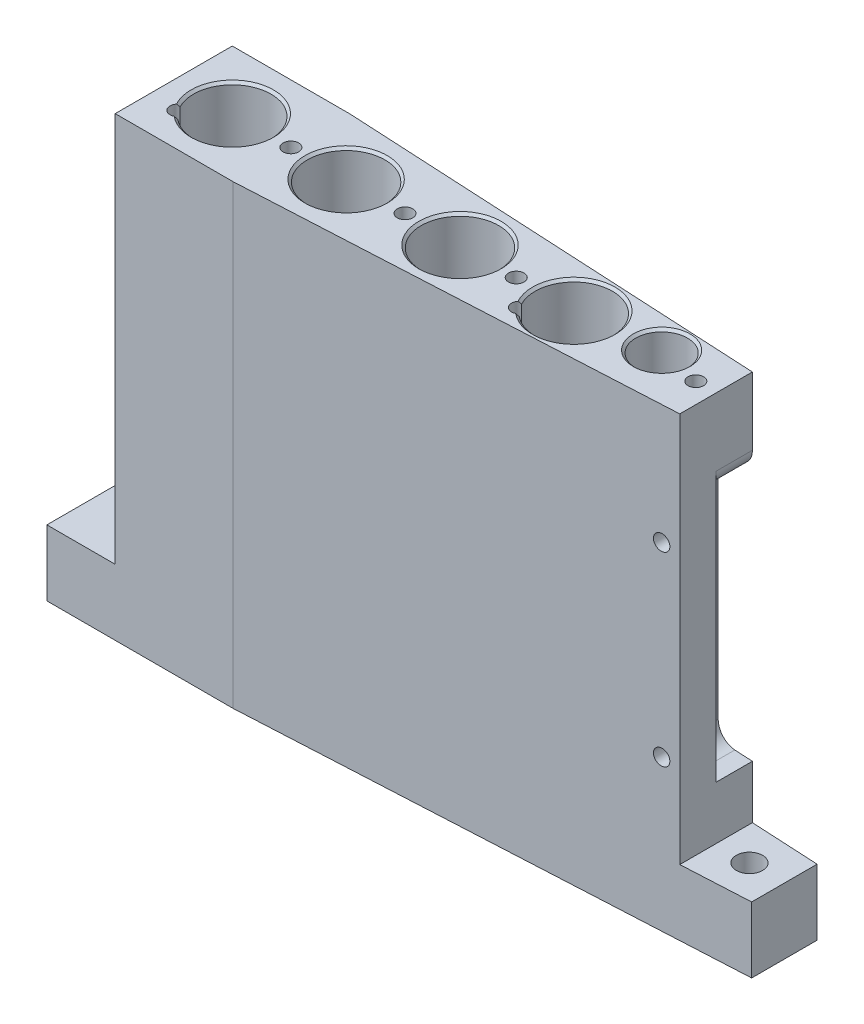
ISO-10303-21;
HEADER;
FILE_DESCRIPTION(('STEP AP214'),'2;1');
FILE_NAME('part.step','',(''),(''),'','','');
FILE_SCHEMA(('AUTOMOTIVE_DESIGN { 1 0 10303 214 1 1 1 1 }'));
ENDSEC;
DATA;
#1=APPLICATION_CONTEXT('core data for automotive mechanical design processes');
#2=APPLICATION_PROTOCOL_DEFINITION('international standard','automotive_design',2000,#1);
#3=PRODUCT_CONTEXT('',#1,'mechanical');
#4=PRODUCT('Part','Part','',(#3));
#5=PRODUCT_RELATED_PRODUCT_CATEGORY('part','',(#4));
#6=PRODUCT_DEFINITION_FORMATION('','',#4);
#7=PRODUCT_DEFINITION_CONTEXT('part definition',#1,'design');
#8=PRODUCT_DEFINITION('design','',#6,#7);
#9=PRODUCT_DEFINITION_SHAPE('','',#8);
#10=(LENGTH_UNIT() NAMED_UNIT(*) SI_UNIT(.MILLI.,.METRE.));
#11=(NAMED_UNIT(*) PLANE_ANGLE_UNIT() SI_UNIT($,.RADIAN.));
#12=(NAMED_UNIT(*) SI_UNIT($,.STERADIAN.) SOLID_ANGLE_UNIT());
#13=UNCERTAINTY_MEASURE_WITH_UNIT(LENGTH_MEASURE(1.E-05),#10,'distance_accuracy_value','');
#14=(GEOMETRIC_REPRESENTATION_CONTEXT(3) GLOBAL_UNCERTAINTY_ASSIGNED_CONTEXT((#13)) GLOBAL_UNIT_ASSIGNED_CONTEXT((#10,
#11,#12)) REPRESENTATION_CONTEXT('',''));
#15=CARTESIAN_POINT('',(0.,0.,0.));
#16=DIRECTION('',(0.,0.,1.));
#17=DIRECTION('',(1.,0.,0.));
#18=AXIS2_PLACEMENT_3D('',#15,#16,#17);
#19=CARTESIAN_POINT('',(69.58,46.75,-3.3534667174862));
#20=DIRECTION('',(-0.0523359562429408,0.,0.998629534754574));
#21=DIRECTION('',(0.998629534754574,0.,0.0523359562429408));
#22=AXIS2_PLACEMENT_3D('',#19,#20,#21);
#23=PLANE('',#22);
#24=DIRECTION('',(0.,1.,0.));
#25=VECTOR('',#24,1.);
#26=CARTESIAN_POINT('',(62.58,-15.6524758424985,-3.72032117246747));
#27=LINE('',#26,#25);
#28=CARTESIAN_POINT('',(62.58,39.8,-3.72032117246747));
#29=VERTEX_POINT('',#28);
#30=CARTESIAN_POINT('',(62.58,46.75,-3.72032117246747));
#31=VERTEX_POINT('',#30);
#32=EDGE_CURVE('E390',#29,#31,#27,.T.);
#33=ORIENTED_EDGE('',*,*,#32,.F.);
#34=CARTESIAN_POINT('',(60.78,39.8,-3.81465517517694));
#35=DIRECTION('',(-0.0523359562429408,0.,0.998629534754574));
#36=DIRECTION('',(-0.998629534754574,0.,-0.0523359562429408));
#37=AXIS2_PLACEMENT_3D('',#34,#35,#36);
#38=ELLIPSE('',#37,1.80247022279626,1.8);
#39=CARTESIAN_POINT('',(60.78,38.,-3.81465517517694));
#40=VERTEX_POINT('',#39);
#41=EDGE_CURVE('E256',#29,#40,#38,.F.);
#42=ORIENTED_EDGE('',*,*,#41,.T.);
#43=DIRECTION('',(-0.998629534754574,0.,-0.0523359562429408));
#44=VECTOR('',#43,1.);
#45=CARTESIAN_POINT('',(69.58,38.,-3.3534667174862));
#46=LINE('',#45,#44);
#47=CARTESIAN_POINT('',(60.68,38.,-3.81989595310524));
#48=VERTEX_POINT('',#47);
#49=EDGE_CURVE('E222',#40,#48,#46,.T.);
#50=ORIENTED_EDGE('',*,*,#49,.T.);
#51=CARTESIAN_POINT('',(60.68,36.2,-3.81989595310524));
#52=DIRECTION('',(-0.0523359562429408,0.,0.998629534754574));
#53=DIRECTION('',(-0.998629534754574,0.,-0.0523359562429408));
#54=AXIS2_PLACEMENT_3D('',#51,#52,#53);
#55=ELLIPSE('',#54,1.80247022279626,1.8);
#56=CARTESIAN_POINT('',(58.88,36.2,-3.91422995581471));
#57=VERTEX_POINT('',#56);
#58=EDGE_CURVE('E50',#48,#57,#55,.T.);
#59=ORIENTED_EDGE('',*,*,#58,.T.);
#60=DIRECTION('',(0.,-1.,0.));
#61=VECTOR('',#60,1.);
#62=CARTESIAN_POINT('',(58.88,46.75,-3.91422995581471));
#63=LINE('',#62,#61);
#64=CARTESIAN_POINT('',(58.88,14.,-3.91422995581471));
#65=VERTEX_POINT('',#64);
#66=EDGE_CURVE('E239',#57,#65,#63,.T.);
#67=ORIENTED_EDGE('',*,*,#66,.T.);
#68=CARTESIAN_POINT('',(60.68,14.,-3.81989595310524));
#69=DIRECTION('',(-0.0523359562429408,0.,0.998629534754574));
#70=DIRECTION('',(-0.998629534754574,0.,-0.0523359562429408));
#71=AXIS2_PLACEMENT_3D('',#68,#69,#70);
#72=ELLIPSE('',#71,1.80247022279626,1.8);
#73=CARTESIAN_POINT('',(60.68,12.2,-3.81989595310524));
#74=VERTEX_POINT('',#73);
#75=EDGE_CURVE('E13',#65,#74,#72,.T.);
#76=ORIENTED_EDGE('',*,*,#75,.T.);
#77=DIRECTION('',(0.998629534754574,0.,0.0523359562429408));
#78=VECTOR('',#77,1.);
#79=CARTESIAN_POINT('',(69.58,12.2,-3.3534667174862));
#80=LINE('',#79,#78);
#81=CARTESIAN_POINT('',(62.58,12.2,-3.72032117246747));
#82=VERTEX_POINT('',#81);
#83=EDGE_CURVE('E289',#74,#82,#80,.T.);
#84=ORIENTED_EDGE('',*,*,#83,.T.);
#85=CARTESIAN_POINT('',(62.58,6.75,-3.72032117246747));
#86=VERTEX_POINT('',#85);
#87=EDGE_CURVE('E238',#86,#82,#27,.T.);
#88=ORIENTED_EDGE('',*,*,#87,.F.);
#89=DIRECTION('',(-0.998629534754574,0.,-0.0523359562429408));
#90=VECTOR('',#89,1.);
#91=CARTESIAN_POINT('',(69.58,6.75,-3.3534667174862));
#92=LINE('',#91,#90);
#93=CARTESIAN_POINT('',(69.58,6.75,-3.3534667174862));
#94=VERTEX_POINT('',#93);
#95=EDGE_CURVE('E395',#94,#86,#92,.T.);
#96=ORIENTED_EDGE('',*,*,#95,.F.);
#97=DIRECTION('',(0.,-1.,0.));
#98=VECTOR('',#97,1.);
#99=CARTESIAN_POINT('',(69.58,46.75,-3.3534667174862));
#100=LINE('',#99,#98);
#101=CARTESIAN_POINT('',(69.58,0.,-3.3534667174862));
#102=VERTEX_POINT('',#101);
#103=EDGE_CURVE('E431',#94,#102,#100,.T.);
#104=ORIENTED_EDGE('',*,*,#103,.T.);
#105=DIRECTION('',(-0.998629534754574,0.,-0.0523359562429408));
#106=VECTOR('',#105,1.);
#107=CARTESIAN_POINT('',(69.58,0.,-3.3534667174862));
#108=LINE('',#107,#106);
#109=CARTESIAN_POINT('',(19.0811366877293,0.,-6.));
#110=VERTEX_POINT('',#109);
#111=EDGE_CURVE('E424',#102,#110,#108,.T.);
#112=ORIENTED_EDGE('',*,*,#111,.T.);
#113=DIRECTION('',(0.,-1.,0.));
#114=VECTOR('',#113,1.);
#115=CARTESIAN_POINT('',(19.0811366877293,46.75,-6.));
#116=LINE('',#115,#114);
#117=CARTESIAN_POINT('',(19.0811366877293,46.75,-6.));
#118=VERTEX_POINT('',#117);
#119=EDGE_CURVE('E310',#118,#110,#116,.T.);
#120=ORIENTED_EDGE('',*,*,#119,.F.);
#121=DIRECTION('',(-0.998629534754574,0.,-0.0523359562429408));
#122=VECTOR('',#121,1.);
#123=CARTESIAN_POINT('',(69.58,46.75,-3.3534667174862));
#124=LINE('',#123,#122);
#125=EDGE_CURVE('E425',#31,#118,#124,.T.);
#126=ORIENTED_EDGE('',*,*,#125,.F.);
#127=EDGE_LOOP('',(#33,#42,#50,#59,#67,#76,#84,#88,#96,#104,#112,#120,#126));
#128=FACE_BOUND('',#127,.T.);
#129=ADVANCED_FACE('F42',(#128),#23,.F.);
#130=CARTESIAN_POINT('',(0.,46.75,7.));
#131=DIRECTION('',(-0.0523359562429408,0.,-0.998629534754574));
#132=DIRECTION('',(-0.998629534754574,0.,0.0523359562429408));
#133=AXIS2_PLACEMENT_3D('',#130,#131,#132);
#134=PLANE('',#133);
#135=CARTESIAN_POINT('',(60.815,34.505,3.81282090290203));
#136=DIRECTION('',(-0.0523359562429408,0.,-0.998629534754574));
#137=DIRECTION('',(0.998629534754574,0.,-0.0523359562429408));
#138=AXIS2_PLACEMENT_3D('',#135,#136,#137);
#139=ELLIPSE('',#138,0.801097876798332,0.799999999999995);
#140=CARTESIAN_POINT('',(61.615,34.505,3.7708946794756));
#141=VERTEX_POINT('',#140);
#142=EDGE_CURVE('E830',#141,#141,#139,.T.);
#143=ORIENTED_EDGE('',*,*,#142,.T.);
#144=EDGE_LOOP('',(#143));
#145=FACE_BOUND('',#144,.T.);
#146=CARTESIAN_POINT('',(60.815,15.455,3.81282090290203));
#147=DIRECTION('',(-0.0523359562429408,0.,-0.998629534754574));
#148=DIRECTION('',(0.998629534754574,0.,-0.0523359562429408));
#149=AXIS2_PLACEMENT_3D('',#146,#147,#148);
#150=ELLIPSE('',#149,0.801097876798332,0.799999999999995);
#151=CARTESIAN_POINT('',(61.615,15.455,3.7708946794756));
#152=VERTEX_POINT('',#151);
#153=EDGE_CURVE('E233',#152,#152,#150,.T.);
#154=ORIENTED_EDGE('',*,*,#153,.T.);
#155=EDGE_LOOP('',(#154));
#156=FACE_BOUND('',#155,.T.);
#157=DIRECTION('',(0.998629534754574,0.,-0.0523359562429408));
#158=VECTOR('',#157,1.);
#159=CARTESIAN_POINT('',(0.,46.75,7.));
#160=LINE('',#159,#158);
#161=CARTESIAN_POINT('',(19.0811366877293,46.75,6.));
#162=VERTEX_POINT('',#161);
#163=CARTESIAN_POINT('',(62.58,46.75,3.72032117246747));
#164=VERTEX_POINT('',#163);
#165=EDGE_CURVE('E428',#162,#164,#160,.T.);
#166=ORIENTED_EDGE('',*,*,#165,.F.);
#167=DIRECTION('',(0.,-1.,0.));
#168=VECTOR('',#167,1.);
#169=CARTESIAN_POINT('',(19.0811366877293,46.75,6.));
#170=LINE('',#169,#168);
#171=CARTESIAN_POINT('',(19.0811366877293,0.,6.));
#172=VERTEX_POINT('',#171);
#173=EDGE_CURVE('E312',#162,#172,#170,.T.);
#174=ORIENTED_EDGE('',*,*,#173,.T.);
#175=DIRECTION('',(0.998629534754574,0.,-0.0523359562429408));
#176=VECTOR('',#175,1.);
#177=CARTESIAN_POINT('',(0.,0.,7.));
#178=LINE('',#177,#176);
#179=CARTESIAN_POINT('',(69.58,0.,3.3534667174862));
#180=VERTEX_POINT('',#179);
#181=EDGE_CURVE('E437',#172,#180,#178,.T.);
#182=ORIENTED_EDGE('',*,*,#181,.T.);
#183=DIRECTION('',(0.,-1.,0.));
#184=VECTOR('',#183,1.);
#185=CARTESIAN_POINT('',(69.58,46.75,3.3534667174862));
#186=LINE('',#185,#184);
#187=CARTESIAN_POINT('',(69.58,6.75,3.3534667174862));
#188=VERTEX_POINT('',#187);
#189=EDGE_CURVE('E442',#188,#180,#186,.T.);
#190=ORIENTED_EDGE('',*,*,#189,.F.);
#191=DIRECTION('',(0.998629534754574,0.,-0.0523359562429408));
#192=VECTOR('',#191,1.);
#193=CARTESIAN_POINT('',(0.,6.75,7.));
#194=LINE('',#193,#192);
#195=CARTESIAN_POINT('',(62.58,6.75,3.72032117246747));
#196=VERTEX_POINT('',#195);
#197=EDGE_CURVE('E386',#196,#188,#194,.T.);
#198=ORIENTED_EDGE('',*,*,#197,.F.);
#199=DIRECTION('',(0.,1.,0.));
#200=VECTOR('',#199,1.);
#201=CARTESIAN_POINT('',(62.58,-15.6524758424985,3.72032117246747));
#202=LINE('',#201,#200);
#203=EDGE_CURVE('E387',#196,#164,#202,.T.);
#204=ORIENTED_EDGE('',*,*,#203,.T.);
#205=EDGE_LOOP('',(#166,#174,#182,#190,#198,#204));
#206=FACE_BOUND('',#205,.T.);
#207=ADVANCED_FACE('F621',(#145,#156,#206),#134,.F.);
#208=CARTESIAN_POINT('',(0.,46.75,-7.));
#209=DIRECTION('',(0.,1.,0.));
#210=DIRECTION('',(0.,0.,1.));
#211=AXIS2_PLACEMENT_3D('',#208,#209,#210);
#212=PLANE('',#211);
#213=CARTESIAN_POINT('',(56.,46.75,-1.));
#214=DIRECTION('',(0.,1.,0.));
#215=DIRECTION('',(0.,0.,1.));
#216=AXIS2_PLACEMENT_3D('',#213,#214,#215);
#217=CIRCLE('',#216,2.90429999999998);
#218=CARTESIAN_POINT('',(56.,46.75,1.90429999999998));
#219=VERTEX_POINT('',#218);
#220=EDGE_CURVE('E674',#219,#219,#217,.F.);
#221=ORIENTED_EDGE('',*,*,#220,.T.);
#222=EDGE_LOOP('',(#221));
#223=FACE_BOUND('',#222,.T.);
#224=CARTESIAN_POINT('',(36.3333333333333,46.75,0.));
#225=DIRECTION('',(0.,1.,0.));
#226=DIRECTION('',(0.,0.,1.));
#227=AXIS2_PLACEMENT_3D('',#224,#225,#226);
#228=CIRCLE('',#227,4.21874999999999);
#229=CARTESIAN_POINT('',(36.3333333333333,46.75,4.21874999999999));
#230=VERTEX_POINT('',#229);
#231=EDGE_CURVE('E669',#230,#230,#228,.F.);
#232=ORIENTED_EDGE('',*,*,#231,.T.);
#233=EDGE_LOOP('',(#232));
#234=FACE_BOUND('',#233,.T.);
#235=CARTESIAN_POINT('',(24.6666666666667,46.75,0.));
#236=DIRECTION('',(0.,1.,0.));
#237=DIRECTION('',(0.,0.,1.));
#238=AXIS2_PLACEMENT_3D('',#235,#236,#237);
#239=CIRCLE('',#238,4.21874999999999);
#240=CARTESIAN_POINT('',(24.6666666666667,46.75,4.21874999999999));
#241=VERTEX_POINT('',#240);
#242=EDGE_CURVE('E666',#241,#241,#239,.F.);
#243=ORIENTED_EDGE('',*,*,#242,.T.);
#244=EDGE_LOOP('',(#243));
#245=FACE_BOUND('',#244,.T.);
#246=DIRECTION('',(1.,0.,0.));
#247=VECTOR('',#246,1.);
#248=CARTESIAN_POINT('',(19.0811366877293,46.75,6.));
#249=LINE('',#248,#247);
#250=CARTESIAN_POINT('',(7.,46.75,6.));
#251=VERTEX_POINT('',#250);
#252=EDGE_CURVE('E297',#251,#162,#249,.T.);
#253=ORIENTED_EDGE('',*,*,#252,.T.);
#254=ORIENTED_EDGE('',*,*,#165,.T.);
#255=DIRECTION('',(0.,0.,-1.));
#256=VECTOR('',#255,1.);
#257=CARTESIAN_POINT('',(62.58,46.75,3.72032117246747));
#258=LINE('',#257,#256);
#259=EDGE_CURVE('E382',#164,#31,#258,.T.);
#260=ORIENTED_EDGE('',*,*,#259,.T.);
#261=ORIENTED_EDGE('',*,*,#125,.T.);
#262=DIRECTION('',(-1.,0.,0.));
#263=VECTOR('',#262,1.);
#264=CARTESIAN_POINT('',(0.,46.75,-6.));
#265=LINE('',#264,#263);
#266=CARTESIAN_POINT('',(7.,46.75,-6.));
#267=VERTEX_POINT('',#266);
#268=EDGE_CURVE('E300',#118,#267,#265,.T.);
#269=ORIENTED_EDGE('',*,*,#268,.T.);
#270=DIRECTION('',(0.,0.,1.));
#271=VECTOR('',#270,1.);
#272=CARTESIAN_POINT('',(7.,46.75,-7.));
#273=LINE('',#272,#271);
#274=EDGE_CURVE('E457',#267,#251,#273,.T.);
#275=ORIENTED_EDGE('',*,*,#274,.T.);
#276=EDGE_LOOP('',(#253,#254,#260,#261,#269,#275));
#277=FACE_BOUND('',#276,.T.);
#278=CARTESIAN_POINT('',(19.,46.75,0.));
#279=DIRECTION('',(0.,1.,0.));
#280=DIRECTION('',(0.,0.,1.));
#281=AXIS2_PLACEMENT_3D('',#278,#279,#280);
#282=CIRCLE('',#281,0.799999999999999);
#283=CARTESIAN_POINT('',(19.,46.75,0.799999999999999));
#284=VERTEX_POINT('',#283);
#285=EDGE_CURVE('E322',#284,#284,#282,.T.);
#286=ORIENTED_EDGE('',*,*,#285,.F.);
#287=EDGE_LOOP('',(#286));
#288=FACE_BOUND('',#287,.T.);
#289=CARTESIAN_POINT('',(30.7,46.75,0.));
#290=DIRECTION('',(0.,1.,0.));
#291=DIRECTION('',(0.,0.,1.));
#292=AXIS2_PLACEMENT_3D('',#289,#290,#291);
#293=CIRCLE('',#292,0.800000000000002);
#294=CARTESIAN_POINT('',(30.7,46.75,0.800000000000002));
#295=VERTEX_POINT('',#294);
#296=EDGE_CURVE('E328',#295,#295,#293,.T.);
#297=ORIENTED_EDGE('',*,*,#296,.F.);
#298=EDGE_LOOP('',(#297));
#299=FACE_BOUND('',#298,.T.);
#300=CARTESIAN_POINT('',(42.1,46.75,0.));
#301=DIRECTION('',(0.,1.,0.));
#302=DIRECTION('',(0.,0.,1.));
#303=AXIS2_PLACEMENT_3D('',#300,#301,#302);
#304=CIRCLE('',#303,0.800000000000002);
#305=CARTESIAN_POINT('',(42.1,46.75,0.800000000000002));
#306=VERTEX_POINT('',#305);
#307=EDGE_CURVE('E334',#306,#306,#304,.T.);
#308=ORIENTED_EDGE('',*,*,#307,.F.);
#309=EDGE_LOOP('',(#308));
#310=FACE_BOUND('',#309,.T.);
#311=CARTESIAN_POINT('',(60.5,46.75,0.));
#312=DIRECTION('',(0.,1.,0.));
#313=DIRECTION('',(0.,0.,1.));
#314=AXIS2_PLACEMENT_3D('',#311,#312,#313);
#315=CIRCLE('',#314,0.800000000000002);
#316=CARTESIAN_POINT('',(60.5,46.75,0.800000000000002));
#317=VERTEX_POINT('',#316);
#318=EDGE_CURVE('E340',#317,#317,#315,.T.);
#319=ORIENTED_EDGE('',*,*,#318,.F.);
#320=EDGE_LOOP('',(#319));
#321=FACE_BOUND('',#320,.T.);
#322=CARTESIAN_POINT('',(44.91763458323,46.75,2.5));
#323=DIRECTION('',(0.,1.,0.));
#324=DIRECTION('',(0.,0.,1.));
#325=AXIS2_PLACEMENT_3D('',#322,#323,#324);
#326=CIRCLE('',#325,0.793749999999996);
#327=CARTESIAN_POINT('',(44.2918085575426,46.75,2.01175738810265));
#328=VERTEX_POINT('',#327);
#329=CARTESIAN_POINT('',(45.2661948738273,46.75,3.21312326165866));
#330=VERTEX_POINT('',#329);
#331=EDGE_CURVE('E346',#328,#330,#326,.T.);
#332=ORIENTED_EDGE('',*,*,#331,.F.);
#333=CARTESIAN_POINT('',(48.,46.75,0.));
#334=DIRECTION('',(0.,1.,0.));
#335=DIRECTION('',(0.,0.,1.));
#336=AXIS2_PLACEMENT_3D('',#333,#334,#335);
#337=CIRCLE('',#336,4.21874999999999);
#338=EDGE_CURVE('E672',#328,#330,#337,.F.);
#339=ORIENTED_EDGE('',*,*,#338,.T.);
#340=EDGE_LOOP('',(#332,#339));
#341=FACE_BOUND('',#340,.T.);
#342=CARTESIAN_POINT('',(9.91763458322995,46.75,2.5));
#343=DIRECTION('',(0.,1.,0.));
#344=DIRECTION('',(0.,0.,1.));
#345=AXIS2_PLACEMENT_3D('',#342,#343,#344);
#346=CIRCLE('',#345,0.793749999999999);
#347=CARTESIAN_POINT('',(9.29180855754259,46.75,2.01175738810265));
#348=VERTEX_POINT('',#347);
#349=CARTESIAN_POINT('',(10.2661948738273,46.75,3.21312326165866));
#350=VERTEX_POINT('',#349);
#351=EDGE_CURVE('E352',#348,#350,#346,.T.);
#352=ORIENTED_EDGE('',*,*,#351,.F.);
#353=CARTESIAN_POINT('',(13.,46.75,0.));
#354=DIRECTION('',(0.,1.,0.));
#355=DIRECTION('',(0.,0.,1.));
#356=AXIS2_PLACEMENT_3D('',#353,#354,#355);
#357=CIRCLE('',#356,4.21875);
#358=EDGE_CURVE('E664',#348,#350,#357,.F.);
#359=ORIENTED_EDGE('',*,*,#358,.T.);
#360=EDGE_LOOP('',(#352,#359));
#361=FACE_BOUND('',#360,.T.);
#362=ADVANCED_FACE('F626',(#223,#234,#245,#277,#288,#299,#310,#321,#341,#361),#212,.T.);
#363=CARTESIAN_POINT('',(69.58,46.75,3.3534667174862));
#364=DIRECTION('',(-1.,0.,0.));
#365=DIRECTION('',(0.,0.,1.));
#366=AXIS2_PLACEMENT_3D('',#363,#364,#365);
#367=PLANE('',#366);
#368=DIRECTION('',(0.,0.,-1.));
#369=VECTOR('',#368,1.);
#370=CARTESIAN_POINT('',(69.58,6.75,3.3534667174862));
#371=LINE('',#370,#369);
#372=EDGE_CURVE('E460',#188,#94,#371,.T.);
#373=ORIENTED_EDGE('',*,*,#372,.F.);
#374=ORIENTED_EDGE('',*,*,#189,.T.);
#375=DIRECTION('',(0.,0.,-1.));
#376=VECTOR('',#375,1.);
#377=CARTESIAN_POINT('',(69.58,0.,3.3534667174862));
#378=LINE('',#377,#376);
#379=EDGE_CURVE('E429',#180,#102,#378,.T.);
#380=ORIENTED_EDGE('',*,*,#379,.T.);
#381=ORIENTED_EDGE('',*,*,#103,.F.);
#382=EDGE_LOOP('',(#373,#374,#380,#381));
#383=FACE_BOUND('',#382,.T.);
#384=ADVANCED_FACE('F694',(#383),#367,.F.);
#385=CARTESIAN_POINT('',(0.,46.75,-7.));
#386=DIRECTION('',(1.,0.,0.));
#387=DIRECTION('',(0.,0.,-1.));
#388=AXIS2_PLACEMENT_3D('',#385,#386,#387);
#389=PLANE('',#388);
#390=DIRECTION('',(0.,0.,1.));
#391=VECTOR('',#390,1.);
#392=CARTESIAN_POINT('',(0.,0.,-7.));
#393=LINE('',#392,#391);
#394=CARTESIAN_POINT('',(0.,0.,-6.));
#395=VERTEX_POINT('',#394);
#396=CARTESIAN_POINT('',(0.,0.,6.));
#397=VERTEX_POINT('',#396);
#398=EDGE_CURVE('E434',#395,#397,#393,.T.);
#399=ORIENTED_EDGE('',*,*,#398,.T.);
#400=DIRECTION('',(0.,-1.,0.));
#401=VECTOR('',#400,1.);
#402=CARTESIAN_POINT('',(0.,46.75,6.));
#403=LINE('',#402,#401);
#404=CARTESIAN_POINT('',(0.,6.75,6.));
#405=VERTEX_POINT('',#404);
#406=EDGE_CURVE('E315',#405,#397,#403,.T.);
#407=ORIENTED_EDGE('',*,*,#406,.F.);
#408=DIRECTION('',(0.,0.,1.));
#409=VECTOR('',#408,1.);
#410=CARTESIAN_POINT('',(0.,6.75,-7.));
#411=LINE('',#410,#409);
#412=CARTESIAN_POINT('',(0.,6.75,-6.));
#413=VERTEX_POINT('',#412);
#414=EDGE_CURVE('E397',#413,#405,#411,.T.);
#415=ORIENTED_EDGE('',*,*,#414,.F.);
#416=DIRECTION('',(0.,-1.,0.));
#417=VECTOR('',#416,1.);
#418=CARTESIAN_POINT('',(0.,46.75,-6.));
#419=LINE('',#418,#417);
#420=EDGE_CURVE('E304',#413,#395,#419,.T.);
#421=ORIENTED_EDGE('',*,*,#420,.T.);
#422=EDGE_LOOP('',(#399,#407,#415,#421));
#423=FACE_BOUND('',#422,.T.);
#424=ADVANCED_FACE('F631',(#423),#389,.F.);
#425=CARTESIAN_POINT('',(36.3333333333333,0.,0.));
#426=DIRECTION('',(0.,-1.,0.));
#427=DIRECTION('',(0.,0.,-1.));
#428=AXIS2_PLACEMENT_3D('',#425,#426,#427);
#429=CYLINDRICAL_SURFACE('',#428,0.793749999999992);
#430=CARTESIAN_POINT('',(36.3333333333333,5.75,0.));
#431=DIRECTION('',(0.,-1.,0.));
#432=DIRECTION('',(0.,0.,-1.));
#433=AXIS2_PLACEMENT_3D('',#430,#431,#432);
#434=CIRCLE('',#433,0.793749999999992);
#435=CARTESIAN_POINT('',(36.3333333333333,5.75,-0.793749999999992));
#436=VERTEX_POINT('',#435);
#437=EDGE_CURVE('E451',#436,#436,#434,.T.);
#438=ORIENTED_EDGE('',*,*,#437,.F.);
#439=EDGE_LOOP('',(#438));
#440=FACE_BOUND('',#439,.T.);
#441=CARTESIAN_POINT('',(36.3333333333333,0.,0.));
#442=DIRECTION('',(0.,-1.,0.));
#443=DIRECTION('',(0.,0.,-1.));
#444=AXIS2_PLACEMENT_3D('',#441,#442,#443);
#445=CIRCLE('',#444,0.793749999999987);
#446=CARTESIAN_POINT('',(36.3333333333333,0.,-0.793749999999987));
#447=VERTEX_POINT('',#446);
#448=EDGE_CURVE('E454',#447,#447,#445,.T.);
#449=ORIENTED_EDGE('',*,*,#448,.T.);
#450=EDGE_LOOP('',(#449));
#451=FACE_BOUND('',#450,.T.);
#452=ADVANCED_FACE('F636',(#440,#451),#429,.F.);
#453=CARTESIAN_POINT('',(24.6666666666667,0.,0.));
#454=DIRECTION('',(0.,-1.,0.));
#455=DIRECTION('',(0.,0.,-1.));
#456=AXIS2_PLACEMENT_3D('',#453,#454,#455);
#457=CYLINDRICAL_SURFACE('',#456,0.793749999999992);
#458=CARTESIAN_POINT('',(24.6666666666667,5.75,0.));
#459=DIRECTION('',(0.,-1.,0.));
#460=DIRECTION('',(0.,0.,-1.));
#461=AXIS2_PLACEMENT_3D('',#458,#459,#460);
#462=CIRCLE('',#461,0.793749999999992);
#463=CARTESIAN_POINT('',(24.6666666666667,5.75,-0.793749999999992));
#464=VERTEX_POINT('',#463);
#465=EDGE_CURVE('E445',#464,#464,#462,.T.);
#466=ORIENTED_EDGE('',*,*,#465,.F.);
#467=EDGE_LOOP('',(#466));
#468=FACE_BOUND('',#467,.T.);
#469=CARTESIAN_POINT('',(24.6666666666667,0.,0.));
#470=DIRECTION('',(0.,-1.,0.));
#471=DIRECTION('',(0.,0.,-1.));
#472=AXIS2_PLACEMENT_3D('',#469,#470,#471);
#473=CIRCLE('',#472,0.793749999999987);
#474=CARTESIAN_POINT('',(24.6666666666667,0.,-0.793749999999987));
#475=VERTEX_POINT('',#474);
#476=EDGE_CURVE('E448',#475,#475,#473,.T.);
#477=ORIENTED_EDGE('',*,*,#476,.T.);
#478=EDGE_LOOP('',(#477));
#479=FACE_BOUND('',#478,.T.);
#480=ADVANCED_FACE('F632',(#468,#479),#457,.F.);
#481=CARTESIAN_POINT('',(0.,0.,-7.));
#482=DIRECTION('',(0.,1.,0.));
#483=DIRECTION('',(0.,0.,1.));
#484=AXIS2_PLACEMENT_3D('',#481,#482,#483);
#485=PLANE('',#484);
#486=CARTESIAN_POINT('',(13.,0.,0.));
#487=DIRECTION('',(0.,-1.,0.));
#488=DIRECTION('',(0.,0.,-1.));
#489=AXIS2_PLACEMENT_3D('',#486,#487,#488);
#490=CIRCLE('',#489,1.3208);
#491=CARTESIAN_POINT('',(13.,0.,-1.3208));
#492=VERTEX_POINT('',#491);
#493=EDGE_CURVE('E291',#492,#492,#490,.T.);
#494=ORIENTED_EDGE('',*,*,#493,.F.);
#495=EDGE_LOOP('',(#494));
#496=FACE_BOUND('',#495,.T.);
#497=CARTESIAN_POINT('',(48.7,0.,0.));
#498=DIRECTION('',(0.,1.,0.));
#499=DIRECTION('',(0.,0.,1.));
#500=AXIS2_PLACEMENT_3D('',#497,#498,#499);
#501=CIRCLE('',#500,1.72699999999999);
#502=CARTESIAN_POINT('',(48.7,0.,1.72699999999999));
#503=VERTEX_POINT('',#502);
#504=EDGE_CURVE('E652',#503,#503,#501,.T.);
#505=ORIENTED_EDGE('',*,*,#504,.T.);
#506=EDGE_LOOP('',(#505));
#507=FACE_BOUND('',#506,.T.);
#508=CARTESIAN_POINT('',(8.,0.,0.));
#509=DIRECTION('',(0.,-1.,0.));
#510=DIRECTION('',(0.,0.,-1.));
#511=AXIS2_PLACEMENT_3D('',#508,#509,#510);
#512=CIRCLE('',#511,0.793749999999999);
#513=CARTESIAN_POINT('',(8.,0.,-0.793749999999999));
#514=VERTEX_POINT('',#513);
#515=EDGE_CURVE('E358',#514,#514,#512,.T.);
#516=ORIENTED_EDGE('',*,*,#515,.F.);
#517=EDGE_LOOP('',(#516));
#518=FACE_BOUND('',#517,.T.);
#519=CARTESIAN_POINT('',(62.,0.,0.));
#520=DIRECTION('',(0.,-1.,0.));
#521=DIRECTION('',(0.,0.,-1.));
#522=AXIS2_PLACEMENT_3D('',#519,#520,#521);
#523=CIRCLE('',#522,0.793749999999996);
#524=CARTESIAN_POINT('',(62.,0.,-0.793749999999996));
#525=VERTEX_POINT('',#524);
#526=EDGE_CURVE('E364',#525,#525,#523,.T.);
#527=ORIENTED_EDGE('',*,*,#526,.F.);
#528=EDGE_LOOP('',(#527));
#529=FACE_BOUND('',#528,.T.);
#530=CARTESIAN_POINT('',(3.5,0.,0.));
#531=DIRECTION('',(0.,1.,0.));
#532=DIRECTION('',(0.,0.,1.));
#533=AXIS2_PLACEMENT_3D('',#530,#531,#532);
#534=CIRCLE('',#533,1.35);
#535=CARTESIAN_POINT('',(3.5,0.,1.35));
#536=VERTEX_POINT('',#535);
#537=EDGE_CURVE('E373',#536,#536,#534,.T.);
#538=ORIENTED_EDGE('',*,*,#537,.T.);
#539=EDGE_LOOP('',(#538));
#540=FACE_BOUND('',#539,.T.);
#541=CARTESIAN_POINT('',(66.,0.,0.));
#542=DIRECTION('',(0.,1.,0.));
#543=DIRECTION('',(0.,0.,1.));
#544=AXIS2_PLACEMENT_3D('',#541,#542,#543);
#545=CIRCLE('',#544,1.35);
#546=CARTESIAN_POINT('',(66.,0.,1.35));
#547=VERTEX_POINT('',#546);
#548=EDGE_CURVE('E379',#547,#547,#545,.T.);
#549=ORIENTED_EDGE('',*,*,#548,.T.);
#550=EDGE_LOOP('',(#549));
#551=FACE_BOUND('',#550,.T.);
#552=CARTESIAN_POINT('',(56.,0.,-1.));
#553=DIRECTION('',(0.,1.,0.));
#554=DIRECTION('',(0.,0.,1.));
#555=AXIS2_PLACEMENT_3D('',#552,#553,#554);
#556=CIRCLE('',#555,2.65429999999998);
#557=CARTESIAN_POINT('',(56.,0.,1.65429999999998));
#558=VERTEX_POINT('',#557);
#559=EDGE_CURVE('E401',#558,#558,#556,.T.);
#560=ORIENTED_EDGE('',*,*,#559,.T.);
#561=EDGE_LOOP('',(#560));
#562=FACE_BOUND('',#561,.T.);
#563=ORIENTED_EDGE('',*,*,#448,.F.);
#564=EDGE_LOOP('',(#563));
#565=FACE_BOUND('',#564,.T.);
#566=ORIENTED_EDGE('',*,*,#476,.F.);
#567=EDGE_LOOP('',(#566));
#568=FACE_BOUND('',#567,.T.);
#569=ORIENTED_EDGE('',*,*,#181,.F.);
#570=DIRECTION('',(1.,0.,0.));
#571=VECTOR('',#570,1.);
#572=CARTESIAN_POINT('',(19.0811366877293,0.,6.));
#573=LINE('',#572,#571);
#574=EDGE_CURVE('E305',#397,#172,#573,.T.);
#575=ORIENTED_EDGE('',*,*,#574,.F.);
#576=ORIENTED_EDGE('',*,*,#398,.F.);
#577=DIRECTION('',(-1.,0.,0.));
#578=VECTOR('',#577,1.);
#579=CARTESIAN_POINT('',(0.,0.,-6.));
#580=LINE('',#579,#578);
#581=EDGE_CURVE('E301',#110,#395,#580,.T.);
#582=ORIENTED_EDGE('',*,*,#581,.F.);
#583=ORIENTED_EDGE('',*,*,#111,.F.);
#584=ORIENTED_EDGE('',*,*,#379,.F.);
#585=EDGE_LOOP('',(#569,#575,#576,#582,#583,#584));
#586=FACE_BOUND('',#585,.T.);
#587=ADVANCED_FACE('F635',(#496,#507,#518,#529,#540,#551,#562,#565,#568,#586),#485,.F.);
#588=CARTESIAN_POINT('',(13.,5.75,0.));
#589=DIRECTION('',(0.,-1.,0.));
#590=DIRECTION('',(0.,0.,-1.));
#591=AXIS2_PLACEMENT_3D('',#588,#589,#590);
#592=PLANE('',#591);
#593=CARTESIAN_POINT('',(13.,5.75,0.));
#594=DIRECTION('',(0.,-1.,0.));
#595=DIRECTION('',(0.,0.,-1.));
#596=AXIS2_PLACEMENT_3D('',#593,#594,#595);
#597=CIRCLE('',#596,0.793749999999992);
#598=CARTESIAN_POINT('',(13.,5.75,-0.793749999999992));
#599=VERTEX_POINT('',#598);
#600=EDGE_CURVE('E418',#599,#599,#597,.T.);
#601=ORIENTED_EDGE('',*,*,#600,.T.);
#602=EDGE_LOOP('',(#601));
#603=FACE_BOUND('',#602,.T.);
#604=CARTESIAN_POINT('',(13.,5.75,0.));
#605=DIRECTION('',(0.,1.,0.));
#606=DIRECTION('',(0.,0.,1.));
#607=AXIS2_PLACEMENT_3D('',#604,#605,#606);
#608=CIRCLE('',#607,3.96874999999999);
#609=CARTESIAN_POINT('',(13.,5.75,3.96874999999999));
#610=VERTEX_POINT('',#609);
#611=EDGE_CURVE('E421',#610,#610,#608,.T.);
#612=ORIENTED_EDGE('',*,*,#611,.T.);
#613=EDGE_LOOP('',(#612));
#614=FACE_BOUND('',#613,.T.);
#615=ADVANCED_FACE('F487',(#603,#614),#592,.F.);
#616=CARTESIAN_POINT('',(13.,46.75,0.));
#617=DIRECTION('',(0.,1.,0.));
#618=DIRECTION('',(0.,0.,1.));
#619=AXIS2_PLACEMENT_3D('',#616,#617,#618);
#620=CYLINDRICAL_SURFACE('',#619,3.96874999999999);
#621=CARTESIAN_POINT('',(9.39720394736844,8.2,1.66458318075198));
#622=CARTESIAN_POINT('',(9.39720015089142,8.25151575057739,1.66457766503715));
#623=CARTESIAN_POINT('',(9.3950788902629,8.30306918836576,1.66000721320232));
#624=CARTESIAN_POINT('',(9.38689600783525,8.40432438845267,1.64211632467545));
#625=CARTESIAN_POINT('',(9.3808289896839,8.45402351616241,1.62878390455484));
#626=CARTESIAN_POINT('',(9.3656158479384,8.54973081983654,1.5945441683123));
#627=CARTESIAN_POINT('',(9.35649439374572,8.59576502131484,1.57369744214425));
#628=CARTESIAN_POINT('',(9.33611399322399,8.68382366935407,1.52564669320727));
#629=CARTESIAN_POINT('',(9.32485412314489,8.72584637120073,1.49843992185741));
#630=CARTESIAN_POINT('',(9.29592501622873,8.82301668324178,1.42580194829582));
#631=CARTESIAN_POINT('',(9.27760225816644,8.87589491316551,1.37759760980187));
#632=CARTESIAN_POINT('',(9.24060805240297,8.9729327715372,1.27320026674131));
#633=CARTESIAN_POINT('',(9.22193591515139,9.01707259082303,1.21698959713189));
#634=CARTESIAN_POINT('',(9.17966040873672,9.11080587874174,1.07835317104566));
#635=CARTESIAN_POINT('',(9.15655709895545,9.15709360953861,0.993540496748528));
#636=CARTESIAN_POINT('',(9.11514381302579,9.23603785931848,0.816790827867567));
#637=CARTESIAN_POINT('',(9.09683703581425,9.26868528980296,0.724849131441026));
#638=CARTESIAN_POINT('',(9.06623219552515,9.32178817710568,0.534684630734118));
#639=CARTESIAN_POINT('',(9.05405211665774,9.34200579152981,0.436376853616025));
#640=CARTESIAN_POINT('',(9.03709875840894,9.369866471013,0.237427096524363));
#641=CARTESIAN_POINT('',(9.03232405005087,9.37751196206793,0.13678557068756));
#642=CARTESIAN_POINT('',(9.03037198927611,9.38066814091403,-0.07922865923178));
#643=CARTESIAN_POINT('',(9.03438036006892,9.37428455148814,-0.194647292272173));
#644=CARTESIAN_POINT('',(9.05217122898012,9.34513518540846,-0.422799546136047));
#645=CARTESIAN_POINT('',(9.06596912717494,9.32234359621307,-0.535528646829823));
#646=CARTESIAN_POINT('',(9.10225905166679,9.25916192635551,-0.755694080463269));
#647=CARTESIAN_POINT('',(9.1248205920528,9.21863079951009,-0.863080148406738));
#648=CARTESIAN_POINT('',(9.16307756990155,9.14354831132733,-1.01577012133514));
#649=CARTESIAN_POINT('',(9.17655438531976,9.11616469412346,-1.06523598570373));
#650=CARTESIAN_POINT('',(9.20445302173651,9.05635997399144,-1.16071507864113));
#651=CARTESIAN_POINT('',(9.21887401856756,9.02394323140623,-1.20673124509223));
#652=CARTESIAN_POINT('',(9.24976278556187,8.94954927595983,-1.29976143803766));
#653=CARTESIAN_POINT('',(9.26626744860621,8.90689030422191,-1.34622509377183));
#654=CARTESIAN_POINT('',(9.29833968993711,8.81465642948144,-1.43205481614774));
#655=CARTESIAN_POINT('',(9.313908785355,8.765093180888,-1.47143259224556));
#656=CARTESIAN_POINT('',(9.33963113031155,8.66965708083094,-1.53414262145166));
#657=CARTESIAN_POINT('',(9.35024664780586,8.62499015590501,-1.55910793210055));
#658=CARTESIAN_POINT('',(9.36880331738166,8.53179268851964,-1.60185281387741));
#659=CARTESIAN_POINT('',(9.37674617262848,8.48326463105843,-1.61963696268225));
#660=CARTESIAN_POINT('',(9.38905485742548,8.3830102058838,-1.64690120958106));
#661=CARTESIAN_POINT('',(9.39339081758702,8.33126087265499,-1.65631201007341));
#662=CARTESIAN_POINT('',(9.39773227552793,8.22674071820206,-1.66573554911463));
#663=CARTESIAN_POINT('',(9.39774078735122,8.17397063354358,-1.66575482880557));
#664=CARTESIAN_POINT('',(9.39372431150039,8.07633282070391,-1.6570351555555));
#665=CARTESIAN_POINT('',(9.39022685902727,8.03133443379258,-1.64944166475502));
#666=CARTESIAN_POINT('',(9.38037237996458,7.94328833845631,-1.62770204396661));
#667=CARTESIAN_POINT('',(9.37401426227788,7.90024138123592,-1.61355341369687));
#668=CARTESIAN_POINT('',(9.35701049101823,7.8056113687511,-1.57485187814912));
#669=CARTESIAN_POINT('',(9.34566940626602,7.75488449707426,-1.54851702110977));
#670=CARTESIAN_POINT('',(9.32072722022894,7.65876582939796,-1.48828521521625));
#671=CARTESIAN_POINT('',(9.30712225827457,7.61338337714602,-1.45437531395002));
#672=CARTESIAN_POINT('',(9.27388589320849,7.51301047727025,-1.36744187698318));
#673=CARTESIAN_POINT('',(9.253831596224,7.46034050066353,-1.31190913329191));
#674=CARTESIAN_POINT('',(9.21423270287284,7.36479083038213,-1.1928565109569));
#675=CARTESIAN_POINT('',(9.19468901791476,7.32192770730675,-1.12932339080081));
#676=CARTESIAN_POINT('',(9.15191662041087,7.23322770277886,-0.97541357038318));
#677=CARTESIAN_POINT('',(9.12947302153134,7.19072576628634,-0.882895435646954));
#678=CARTESIAN_POINT('',(9.09070596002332,7.12022188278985,-0.691363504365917));
#679=CARTESIAN_POINT('',(9.07438571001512,7.09222754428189,-0.592346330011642));
#680=CARTESIAN_POINT('',(9.0490320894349,7.04955971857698,-0.389163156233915));
#681=CARTESIAN_POINT('',(9.04010124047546,7.03507330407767,-0.284945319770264));
#682=CARTESIAN_POINT('',(9.03057042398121,7.01963452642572,-0.075135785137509));
#683=CARTESIAN_POINT('',(9.02997230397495,7.01868516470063,0.0304562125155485));
#684=CARTESIAN_POINT('',(9.03754816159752,7.03092192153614,0.25203578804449));
#685=CARTESIAN_POINT('',(9.04667978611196,7.04565103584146,0.36790987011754));
#686=CARTESIAN_POINT('',(9.07444728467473,7.09228480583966,0.595037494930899));
#687=CARTESIAN_POINT('',(9.09308123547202,7.12418598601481,0.70629196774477));
#688=CARTESIAN_POINT('',(9.13279794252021,7.19713342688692,0.896061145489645));
#689=CARTESIAN_POINT('',(9.15238604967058,7.23450634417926,0.976309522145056));
#690=CARTESIAN_POINT('',(9.19447351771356,7.32121405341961,1.12924216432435));
#691=CARTESIAN_POINT('',(9.21696809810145,7.37052931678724,1.20193850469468));
#692=CARTESIAN_POINT('',(9.25605616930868,7.46653586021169,1.31776693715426));
#693=CARTESIAN_POINT('',(9.27254891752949,7.51013491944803,1.36349506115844));
#694=CARTESIAN_POINT('',(9.30440780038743,7.60431890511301,1.44761409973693));
#695=CARTESIAN_POINT('',(9.31977537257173,7.65489467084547,1.48601448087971));
#696=CARTESIAN_POINT('',(9.34469428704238,7.75129289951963,1.54613929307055));
#697=CARTESIAN_POINT('',(9.35478762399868,7.79584134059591,1.56967335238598));
#698=CARTESIAN_POINT('',(9.37223403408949,7.88852226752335,1.60958635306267));
#699=CARTESIAN_POINT('',(9.37959209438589,7.93664803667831,1.62597832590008));
#700=CARTESIAN_POINT('',(9.38907517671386,8.02081811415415,1.64690259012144));
#701=CARTESIAN_POINT('',(9.39210273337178,8.05625416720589,1.65350482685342));
#702=CARTESIAN_POINT('',(9.39616856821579,8.12778725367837,1.66234731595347));
#703=CARTESIAN_POINT('',(9.39720660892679,8.16388436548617,1.66458704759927));
#704=CARTESIAN_POINT('',(9.39720394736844,8.2,1.66458318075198));
#705=B_SPLINE_CURVE_WITH_KNOTS('',3,(#621,#622,#623,#624,#625,#626,#627,#628,#629,#630,#631,
#632,#633,#634,#635,#636,#637,#638,#639,#640,#641,#642,#643,#644,#645,#646,#647,#648,#649,#650,
#651,#652,#653,#654,#655,#656,#657,#658,#659,#660,#661,#662,#663,#664,#665,#666,#667,#668,#669,
#670,#671,#672,#673,#674,#675,#676,#677,#678,#679,#680,#681,#682,#683,#684,#685,#686,#687,#688,
#689,#690,#691,#692,#693,#694,#695,#696,#697,#698,#699,#700,#701,#702,#703,#704),.UNSPECIFIED.,
.T.,.F.,(4,2,2,2,2,2,2,2,2,2,2,2,2,2,2,2,2,2,2,2,2,2,2,2,2,2,2,2,2,2,2,2,2,2,2,2,2,2,2,2,2,4),
(0.,0.15438043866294,0.308972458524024,0.462344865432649,0.615783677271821,0.836144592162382,
1.05699946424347,1.35345911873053,1.6501159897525,1.95228574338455,2.25439718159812,
2.59976661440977,2.94568056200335,3.29439628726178,3.46850360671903,3.64246092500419,
3.83742222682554,4.03205833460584,4.18823539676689,4.34431274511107,4.50167008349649,
4.65891782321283,4.79559369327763,4.93232173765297,5.10617739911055,5.28033263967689,
5.51640519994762,5.75287375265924,6.06401253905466,6.37531433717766,6.69086600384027,
7.00648763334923,7.35631283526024,7.70606726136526,7.97711647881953,8.24772542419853,
8.44299159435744,8.63800377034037,8.79157251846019,8.94485987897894,9.05307692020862,
9.16130687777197),.UNSPECIFIED.);
#706=CARTESIAN_POINT('',(9.39720394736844,8.2,1.66458318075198));
#707=VERTEX_POINT('',#706);
#708=EDGE_CURVE('E321',#707,#707,#705,.T.);
#709=ORIENTED_EDGE('',*,*,#708,.T.);
#710=EDGE_LOOP('',(#709));
#711=FACE_BOUND('',#710,.T.);
#712=ORIENTED_EDGE('',*,*,#611,.F.);
#713=EDGE_LOOP('',(#712));
#714=FACE_BOUND('',#713,.T.);
#715=DIRECTION('',(0.,1.,0.));
#716=VECTOR('',#715,1.);
#717=CARTESIAN_POINT('',(10.4767756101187,43.75,3.06338297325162));
#718=LINE('',#717,#716);
#719=CARTESIAN_POINT('',(10.4767756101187,40.75,3.06338297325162));
#720=VERTEX_POINT('',#719);
#721=CARTESIAN_POINT('',(10.4767756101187,46.5,3.06338297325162));
#722=VERTEX_POINT('',#721);
#723=EDGE_CURVE('E1245',#720,#722,#718,.T.);
#724=ORIENTED_EDGE('',*,*,#723,.T.);
#725=CARTESIAN_POINT('',(13.,46.5,0.));
#726=DIRECTION('',(0.,1.,0.));
#727=DIRECTION('',(0.,0.,1.));
#728=AXIS2_PLACEMENT_3D('',#725,#726,#727);
#729=CIRCLE('',#728,3.96874999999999);
#730=CARTESIAN_POINT('',(9.48178817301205,46.5,1.83661702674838));
#731=VERTEX_POINT('',#730);
#732=EDGE_CURVE('E701',#722,#731,#729,.T.);
#733=ORIENTED_EDGE('',*,*,#732,.T.);
#734=DIRECTION('',(0.,1.,0.));
#735=VECTOR('',#734,1.);
#736=CARTESIAN_POINT('',(9.48178817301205,43.75,1.83661702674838));
#737=LINE('',#736,#735);
#738=CARTESIAN_POINT('',(9.48178817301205,40.75,1.83661702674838));
#739=VERTEX_POINT('',#738);
#740=EDGE_CURVE('E1248',#731,#739,#737,.F.);
#741=ORIENTED_EDGE('',*,*,#740,.T.);
#742=CARTESIAN_POINT('',(9.91763458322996,40.2730668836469,2.5));
#743=CARTESIAN_POINT('',(9.91763064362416,40.2730706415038,2.49999514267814));
#744=CARTESIAN_POINT('',(9.91762670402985,40.2730743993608,2.49999028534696));
#745=CARTESIAN_POINT('',(9.91758676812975,40.2731124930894,2.49994104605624));
#746=CARTESIAN_POINT('',(9.91755077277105,40.273146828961,2.49989666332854));
#747=CARTESIAN_POINT('',(9.91737080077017,40.2733185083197,2.49967474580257));
#748=CARTESIAN_POINT('',(9.91722683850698,40.273455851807,2.49949719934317));
#749=CARTESIAN_POINT('',(9.91650710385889,40.274142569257,2.49860940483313));
#750=CARTESIAN_POINT('',(9.9159315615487,40.2746919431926,2.49789897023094));
#751=CARTESIAN_POINT('',(9.91305507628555,40.277438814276,2.49434580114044));
#752=CARTESIAN_POINT('',(9.91075781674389,40.2796363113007,2.49150008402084));
#753=CARTESIAN_POINT('',(9.89929110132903,40.2906238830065,2.47725551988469));
#754=CARTESIAN_POINT('',(9.89018068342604,40.2994139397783,2.46580909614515));
#755=CARTESIAN_POINT('',(9.84493988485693,40.3433697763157,2.40831835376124));
#756=CARTESIAN_POINT('',(9.80976202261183,40.3785344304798,2.36152115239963));
#757=CARTESIAN_POINT('',(9.6387268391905,40.5547175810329,2.12319684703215));
#758=CARTESIAN_POINT('',(9.51864161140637,40.695663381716,1.92014623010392));
#759=CARTESIAN_POINT('',(9.41726955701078,40.8362982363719,1.70734271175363));
#760=B_SPLINE_CURVE_WITH_KNOTS('',3,(#742,#743,#744,#745,#746,#747,#748,#749,#750,#751,#752,
#753,#754,#755,#756,#757,#758,#759),.UNSPECIFIED.,.F.,.F.,(4,2,2,2,2,2,2,2,4),(0.,
2.18888104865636E-05,0.000221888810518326,0.00102188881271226,0.00422188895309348,
0.0170218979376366,0.068222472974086,0.27305930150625,1.09464358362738),.UNSPECIFIED.);
#761=CARTESIAN_POINT('',(9.91763458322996,40.2730668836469,2.5));
#762=VERTEX_POINT('',#761);
#763=EDGE_CURVE('E462',#739,#762,#760,.F.);
#764=ORIENTED_EDGE('',*,*,#763,.T.);
#765=CARTESIAN_POINT('',(9.91763458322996,40.2730668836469,2.5));
#766=CARTESIAN_POINT('',(9.91763852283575,40.2730706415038,2.50000485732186));
#767=CARTESIAN_POINT('',(9.91764246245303,40.2730743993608,2.50000971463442));
#768=CARTESIAN_POINT('',(9.91768239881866,40.2731124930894,2.50005895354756));
#769=CARTESIAN_POINT('',(9.91771839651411,40.273146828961,2.50010333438));
#770=CARTESIAN_POINT('',(9.91789838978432,40.2733185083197,2.50032523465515));
#771=CARTESIAN_POINT('',(9.91804239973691,40.273455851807,2.50050274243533));
#772=CARTESIAN_POINT('',(9.91876252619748,40.274142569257,2.50139021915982));
#773=CARTESIAN_POINT('',(9.91933887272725,40.2746919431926,2.50210000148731));
#774=CARTESIAN_POINT('',(9.92222183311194,40.277438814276,2.50564791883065));
#775=CARTESIAN_POINT('',(9.92453212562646,40.2796363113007,2.50848306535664));
#776=CARTESIAN_POINT('',(9.9361032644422,40.2906238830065,2.52264293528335));
#777=CARTESIAN_POINT('',(9.94542284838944,40.2994139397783,2.53391971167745));
#778=CARTESIAN_POINT('',(9.9923380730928,40.3433697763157,2.59005238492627));
#779=CARTESIAN_POINT('',(10.0308669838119,40.3785344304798,2.63413166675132));
#780=CARTESIAN_POINT('',(10.2287583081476,40.5547175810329,2.85067388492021));
#781=CARTESIAN_POINT('',(10.4026514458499,40.6956633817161,3.01008276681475));
#782=CARTESIAN_POINT('',(10.5899498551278,40.8362982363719,3.153194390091));
#783=B_SPLINE_CURVE_WITH_KNOTS('',3,(#765,#766,#767,#768,#769,#770,#771,#772,#773,#774,#775,
#776,#777,#778,#779,#780,#781,#782),.UNSPECIFIED.,.F.,.F.,(4,2,2,2,2,2,2,2,4),(0.,
2.18888104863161E-05,0.000221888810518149,0.00102188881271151,0.00422188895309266,
0.017021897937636,0.0682224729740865,0.27305930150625,1.09464358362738),.UNSPECIFIED.);
#784=EDGE_CURVE('E471',#762,#720,#783,.T.);
#785=ORIENTED_EDGE('',*,*,#784,.T.);
#786=EDGE_LOOP('',(#724,#733,#741,#764,#785));
#787=FACE_BOUND('',#786,.T.);
#788=ADVANCED_FACE('F481',(#711,#714,#787),#620,.F.);
#789=CARTESIAN_POINT('',(13.,0.,0.));
#790=DIRECTION('',(0.,-1.,0.));
#791=DIRECTION('',(0.,0.,-1.));
#792=AXIS2_PLACEMENT_3D('',#789,#790,#791);
#793=CYLINDRICAL_SURFACE('',#792,0.793749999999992);
#794=CARTESIAN_POINT('',(13.,4.31668358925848,0.));
#795=DIRECTION('',(0.,-1.,0.));
#796=DIRECTION('',(0.,0.,-1.));
#797=AXIS2_PLACEMENT_3D('',#794,#795,#796);
#798=CIRCLE('',#797,0.793749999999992);
#799=CARTESIAN_POINT('',(13.,4.31668358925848,-0.793749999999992));
#800=VERTEX_POINT('',#799);
#801=EDGE_CURVE('E248',#800,#800,#798,.T.);
#802=ORIENTED_EDGE('',*,*,#801,.T.);
#803=EDGE_LOOP('',(#802));
#804=FACE_BOUND('',#803,.T.);
#805=ORIENTED_EDGE('',*,*,#600,.F.);
#806=EDGE_LOOP('',(#805));
#807=FACE_BOUND('',#806,.T.);
#808=ADVANCED_FACE('F486',(#804,#807),#793,.F.);
#809=CARTESIAN_POINT('',(24.6666666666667,5.75,0.));
#810=DIRECTION('',(0.,-1.,0.));
#811=DIRECTION('',(0.,0.,-1.));
#812=AXIS2_PLACEMENT_3D('',#809,#810,#811);
#813=PLANE('',#812);
#814=ORIENTED_EDGE('',*,*,#465,.T.);
#815=EDGE_LOOP('',(#814));
#816=FACE_BOUND('',#815,.T.);
#817=CARTESIAN_POINT('',(24.6666666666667,5.75,0.));
#818=DIRECTION('',(0.,1.,0.));
#819=DIRECTION('',(0.,0.,1.));
#820=AXIS2_PLACEMENT_3D('',#817,#818,#819);
#821=CIRCLE('',#820,3.96874999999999);
#822=CARTESIAN_POINT('',(24.6666666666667,5.75,3.96874999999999));
#823=VERTEX_POINT('',#822);
#824=EDGE_CURVE('E415',#823,#823,#821,.T.);
#825=ORIENTED_EDGE('',*,*,#824,.T.);
#826=EDGE_LOOP('',(#825));
#827=FACE_BOUND('',#826,.T.);
#828=ADVANCED_FACE('F727',(#816,#827),#813,.F.);
#829=CARTESIAN_POINT('',(24.6666666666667,46.75,0.));
#830=DIRECTION('',(0.,1.,0.));
#831=DIRECTION('',(0.,0.,1.));
#832=AXIS2_PLACEMENT_3D('',#829,#830,#831);
#833=CYLINDRICAL_SURFACE('',#832,3.96874999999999);
#834=CARTESIAN_POINT('',(24.6666666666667,46.5,0.));
#835=DIRECTION('',(0.,1.,0.));
#836=DIRECTION('',(0.,0.,1.));
#837=AXIS2_PLACEMENT_3D('',#834,#835,#836);
#838=CIRCLE('',#837,3.96874999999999);
#839=CARTESIAN_POINT('',(24.6666666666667,46.5,3.96874999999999));
#840=VERTEX_POINT('',#839);
#841=EDGE_CURVE('E703',#840,#840,#838,.T.);
#842=ORIENTED_EDGE('',*,*,#841,.T.);
#843=EDGE_LOOP('',(#842));
#844=FACE_BOUND('',#843,.T.);
#845=ORIENTED_EDGE('',*,*,#824,.F.);
#846=EDGE_LOOP('',(#845));
#847=FACE_BOUND('',#846,.T.);
#848=ADVANCED_FACE('F721',(#844,#847),#833,.F.);
#849=CARTESIAN_POINT('',(36.3333333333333,5.75,0.));
#850=DIRECTION('',(0.,-1.,0.));
#851=DIRECTION('',(0.,0.,-1.));
#852=AXIS2_PLACEMENT_3D('',#849,#850,#851);
#853=PLANE('',#852);
#854=ORIENTED_EDGE('',*,*,#437,.T.);
#855=EDGE_LOOP('',(#854));
#856=FACE_BOUND('',#855,.T.);
#857=CARTESIAN_POINT('',(36.3333333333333,5.75,0.));
#858=DIRECTION('',(0.,1.,0.));
#859=DIRECTION('',(0.,0.,1.));
#860=AXIS2_PLACEMENT_3D('',#857,#858,#859);
#861=CIRCLE('',#860,3.96874999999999);
#862=CARTESIAN_POINT('',(36.3333333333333,5.75,3.96874999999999));
#863=VERTEX_POINT('',#862);
#864=EDGE_CURVE('E412',#863,#863,#861,.T.);
#865=ORIENTED_EDGE('',*,*,#864,.T.);
#866=EDGE_LOOP('',(#865));
#867=FACE_BOUND('',#866,.T.);
#868=ADVANCED_FACE('F716',(#856,#867),#853,.F.);
#869=CARTESIAN_POINT('',(36.3333333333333,46.75,0.));
#870=DIRECTION('',(0.,1.,0.));
#871=DIRECTION('',(0.,0.,1.));
#872=AXIS2_PLACEMENT_3D('',#869,#870,#871);
#873=CYLINDRICAL_SURFACE('',#872,3.96874999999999);
#874=CARTESIAN_POINT('',(36.3333333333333,46.5,0.));
#875=DIRECTION('',(0.,1.,0.));
#876=DIRECTION('',(0.,0.,1.));
#877=AXIS2_PLACEMENT_3D('',#874,#875,#876);
#878=CIRCLE('',#877,3.96874999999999);
#879=CARTESIAN_POINT('',(36.3333333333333,46.5,3.96874999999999));
#880=VERTEX_POINT('',#879);
#881=EDGE_CURVE('E569',#880,#880,#878,.T.);
#882=ORIENTED_EDGE('',*,*,#881,.T.);
#883=EDGE_LOOP('',(#882));
#884=FACE_BOUND('',#883,.T.);
#885=ORIENTED_EDGE('',*,*,#864,.F.);
#886=EDGE_LOOP('',(#885));
#887=FACE_BOUND('',#886,.T.);
#888=ADVANCED_FACE('F711',(#884,#887),#873,.F.);
#889=CARTESIAN_POINT('',(48.,5.75,0.));
#890=DIRECTION('',(0.,-1.,0.));
#891=DIRECTION('',(0.,0.,-1.));
#892=AXIS2_PLACEMENT_3D('',#889,#890,#891);
#893=PLANE('',#892);
#894=CARTESIAN_POINT('',(48.7,5.75,0.));
#895=DIRECTION('',(0.,-1.,0.));
#896=DIRECTION('',(0.,0.,-1.));
#897=AXIS2_PLACEMENT_3D('',#894,#895,#896);
#898=CIRCLE('',#897,0.793749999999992);
#899=CARTESIAN_POINT('',(48.7,5.75,-0.793749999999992));
#900=VERTEX_POINT('',#899);
#901=EDGE_CURVE('E406',#900,#900,#898,.T.);
#902=ORIENTED_EDGE('',*,*,#901,.T.);
#903=EDGE_LOOP('',(#902));
#904=FACE_BOUND('',#903,.T.);
#905=CARTESIAN_POINT('',(48.,5.75,0.));
#906=DIRECTION('',(0.,1.,0.));
#907=DIRECTION('',(0.,0.,1.));
#908=AXIS2_PLACEMENT_3D('',#905,#906,#907);
#909=CIRCLE('',#908,3.96874999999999);
#910=CARTESIAN_POINT('',(48.,5.75,3.96874999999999));
#911=VERTEX_POINT('',#910);
#912=EDGE_CURVE('E409',#911,#911,#909,.T.);
#913=ORIENTED_EDGE('',*,*,#912,.T.);
#914=EDGE_LOOP('',(#913));
#915=FACE_BOUND('',#914,.T.);
#916=ADVANCED_FACE('F715',(#904,#915),#893,.F.);
#917=CARTESIAN_POINT('',(48.,46.75,0.));
#918=DIRECTION('',(0.,1.,0.));
#919=DIRECTION('',(0.,0.,1.));
#920=AXIS2_PLACEMENT_3D('',#917,#918,#919);
#921=CYLINDRICAL_SURFACE('',#920,3.96874999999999);
#922=ORIENTED_EDGE('',*,*,#912,.F.);
#923=EDGE_LOOP('',(#922));
#924=FACE_BOUND('',#923,.T.);
#925=DIRECTION('',(0.,1.,0.));
#926=VECTOR('',#925,1.);
#927=CARTESIAN_POINT('',(45.4767756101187,43.75,3.06338297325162));
#928=LINE('',#927,#926);
#929=CARTESIAN_POINT('',(45.4767756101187,40.75,3.06338297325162));
#930=VERTEX_POINT('',#929);
#931=CARTESIAN_POINT('',(45.4767756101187,46.5,3.06338297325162));
#932=VERTEX_POINT('',#931);
#933=EDGE_CURVE('E501',#930,#932,#928,.T.);
#934=ORIENTED_EDGE('',*,*,#933,.T.);
#935=CARTESIAN_POINT('',(48.,46.5,0.));
#936=DIRECTION('',(0.,1.,0.));
#937=DIRECTION('',(0.,0.,1.));
#938=AXIS2_PLACEMENT_3D('',#935,#936,#937);
#939=CIRCLE('',#938,3.96874999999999);
#940=CARTESIAN_POINT('',(44.481788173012,46.5,1.83661702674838));
#941=VERTEX_POINT('',#940);
#942=EDGE_CURVE('E676',#932,#941,#939,.T.);
#943=ORIENTED_EDGE('',*,*,#942,.T.);
#944=DIRECTION('',(0.,1.,0.));
#945=VECTOR('',#944,1.);
#946=CARTESIAN_POINT('',(44.481788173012,43.75,1.83661702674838));
#947=LINE('',#946,#945);
#948=CARTESIAN_POINT('',(44.481788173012,40.75,1.83661702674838));
#949=VERTEX_POINT('',#948);
#950=EDGE_CURVE('E690',#941,#949,#947,.F.);
#951=ORIENTED_EDGE('',*,*,#950,.T.);
#952=CARTESIAN_POINT('',(44.91763458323,40.2730668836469,2.5));
#953=CARTESIAN_POINT('',(44.9176306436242,40.2730706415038,2.49999514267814));
#954=CARTESIAN_POINT('',(44.9176267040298,40.2730743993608,2.49999028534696));
#955=CARTESIAN_POINT('',(44.9175867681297,40.2731124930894,2.49994104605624));
#956=CARTESIAN_POINT('',(44.9175507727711,40.273146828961,2.49989666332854));
#957=CARTESIAN_POINT('',(44.9173708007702,40.2733185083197,2.49967474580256));
#958=CARTESIAN_POINT('',(44.917226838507,40.273455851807,2.49949719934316));
#959=CARTESIAN_POINT('',(44.9165071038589,40.274142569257,2.49860940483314));
#960=CARTESIAN_POINT('',(44.9159315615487,40.2746919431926,2.49789897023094));
#961=CARTESIAN_POINT('',(44.9130550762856,40.277438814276,2.49434580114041));
#962=CARTESIAN_POINT('',(44.9107578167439,40.2796363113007,2.49150008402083));
#963=CARTESIAN_POINT('',(44.899291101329,40.2906238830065,2.47725551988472));
#964=CARTESIAN_POINT('',(44.890180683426,40.2994139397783,2.46580909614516));
#965=CARTESIAN_POINT('',(44.844939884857,40.3433697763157,2.40831835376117));
#966=CARTESIAN_POINT('',(44.8097620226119,40.3785344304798,2.36152115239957));
#967=CARTESIAN_POINT('',(44.6387268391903,40.5547175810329,2.12319684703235));
#968=CARTESIAN_POINT('',(44.5186416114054,40.6956633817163,1.9201462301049));
#969=CARTESIAN_POINT('',(44.4172695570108,40.8362982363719,1.70734271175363));
#970=B_SPLINE_CURVE_WITH_KNOTS('',3,(#952,#953,#954,#955,#956,#957,#958,#959,#960,#961,#962,
#963,#964,#965,#966,#967,#968,#969),.UNSPECIFIED.,.F.,.F.,(4,2,2,2,2,2,2,2,4),(0.,
2.18888104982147E-05,0.000221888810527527,0.00102188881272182,0.00422188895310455,
0.0170218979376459,0.0682224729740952,0.273059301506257,1.09464358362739),.UNSPECIFIED.);
#971=CARTESIAN_POINT('',(44.91763458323,40.2730668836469,2.5));
#972=VERTEX_POINT('',#971);
#973=EDGE_CURVE('E1247',#949,#972,#970,.F.);
#974=ORIENTED_EDGE('',*,*,#973,.T.);
#975=CARTESIAN_POINT('',(44.91763458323,40.2730668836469,2.5));
#976=CARTESIAN_POINT('',(44.9176385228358,40.2730706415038,2.50000485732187));
#977=CARTESIAN_POINT('',(44.917642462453,40.2730743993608,2.50000971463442));
#978=CARTESIAN_POINT('',(44.9176823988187,40.2731124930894,2.50005895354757));
#979=CARTESIAN_POINT('',(44.9177183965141,40.273146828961,2.50010333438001));
#980=CARTESIAN_POINT('',(44.9178983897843,40.2733185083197,2.50032523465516));
#981=CARTESIAN_POINT('',(44.9180423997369,40.273455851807,2.50050274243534));
#982=CARTESIAN_POINT('',(44.9187625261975,40.274142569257,2.50139021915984));
#983=CARTESIAN_POINT('',(44.9193388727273,40.2746919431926,2.50210000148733));
#984=CARTESIAN_POINT('',(44.922221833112,40.277438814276,2.50564791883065));
#985=CARTESIAN_POINT('',(44.9245321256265,40.2796363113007,2.50848306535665));
#986=CARTESIAN_POINT('',(44.9361032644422,40.2906238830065,2.52264293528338));
#987=CARTESIAN_POINT('',(44.9454228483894,40.2994139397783,2.53391971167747));
#988=CARTESIAN_POINT('',(44.9923380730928,40.3433697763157,2.59005238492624));
#989=CARTESIAN_POINT('',(45.0308669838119,40.3785344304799,2.6341316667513));
#990=CARTESIAN_POINT('',(45.2287583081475,40.5547175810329,2.85067388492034));
#991=CARTESIAN_POINT('',(45.4026514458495,40.6956633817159,3.01008276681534));
#992=CARTESIAN_POINT('',(45.5899498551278,40.8362982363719,3.15319439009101));
#993=B_SPLINE_CURVE_WITH_KNOTS('',3,(#975,#976,#977,#978,#979,#980,#981,#982,#983,#984,#985,
#986,#987,#988,#989,#990,#991,#992),.UNSPECIFIED.,.F.,.F.,(4,2,2,2,2,2,2,2,4),(0.,
2.18888105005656E-05,0.000221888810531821,0.0010218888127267,0.00422188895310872,
0.0170218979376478,0.0682224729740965,0.27305930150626,1.09464358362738),.UNSPECIFIED.);
#994=EDGE_CURVE('E689',#972,#930,#993,.T.);
#995=ORIENTED_EDGE('',*,*,#994,.T.);
#996=EDGE_LOOP('',(#934,#943,#951,#974,#995));
#997=FACE_BOUND('',#996,.T.);
#998=ADVANCED_FACE('F687',(#924,#997),#921,.F.);
#999=CARTESIAN_POINT('',(48.7,0.,0.));
#1000=DIRECTION('',(0.,-1.,0.));
#1001=DIRECTION('',(0.,0.,-1.));
#1002=AXIS2_PLACEMENT_3D('',#999,#1000,#1001);
#1003=CYLINDRICAL_SURFACE('',#1002,0.793749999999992);
#1004=CARTESIAN_POINT('',(48.7,0.538812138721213,0.));
#1005=DIRECTION('',(0.,1.,0.));
#1006=DIRECTION('',(0.,0.,1.));
#1007=AXIS2_PLACEMENT_3D('',#1004,#1005,#1006);
#1008=CIRCLE('',#1007,0.793749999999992);
#1009=CARTESIAN_POINT('',(48.7,0.538812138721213,0.793749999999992));
#1010=VERTEX_POINT('',#1009);
#1011=EDGE_CURVE('E655',#1010,#1010,#1008,.F.);
#1012=ORIENTED_EDGE('',*,*,#1011,.T.);
#1013=EDGE_LOOP('',(#1012));
#1014=FACE_BOUND('',#1013,.T.);
#1015=ORIENTED_EDGE('',*,*,#901,.F.);
#1016=EDGE_LOOP('',(#1015));
#1017=FACE_BOUND('',#1016,.T.);
#1018=ADVANCED_FACE('F965',(#1014,#1017),#1003,.F.);
#1019=CARTESIAN_POINT('',(56.,46.75,-1.));
#1020=DIRECTION('',(0.,1.,0.));
#1021=DIRECTION('',(0.,0.,1.));
#1022=AXIS2_PLACEMENT_3D('',#1019,#1020,#1021);
#1023=CYLINDRICAL_SURFACE('',#1022,2.65429999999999);
#1024=CARTESIAN_POINT('',(56.,46.5,-1.));
#1025=DIRECTION('',(0.,1.,0.));
#1026=DIRECTION('',(0.,0.,1.));
#1027=AXIS2_PLACEMENT_3D('',#1024,#1025,#1026);
#1028=CIRCLE('',#1027,2.65429999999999);
#1029=CARTESIAN_POINT('',(56.,46.5,1.65429999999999));
#1030=VERTEX_POINT('',#1029);
#1031=EDGE_CURVE('E659',#1030,#1030,#1028,.T.);
#1032=ORIENTED_EDGE('',*,*,#1031,.T.);
#1033=EDGE_LOOP('',(#1032));
#1034=FACE_BOUND('',#1033,.T.);
#1035=ORIENTED_EDGE('',*,*,#559,.F.);
#1036=EDGE_LOOP('',(#1035));
#1037=FACE_BOUND('',#1036,.T.);
#1038=ADVANCED_FACE('F960',(#1034,#1037),#1023,.F.);
#1039=CARTESIAN_POINT('',(0.,6.75,-7.));
#1040=DIRECTION('',(0.,1.,0.));
#1041=DIRECTION('',(0.,0.,1.));
#1042=AXIS2_PLACEMENT_3D('',#1039,#1040,#1041);
#1043=PLANE('',#1042);
#1044=DIRECTION('',(-1.,0.,0.));
#1045=VECTOR('',#1044,1.);
#1046=CARTESIAN_POINT('',(0.,6.75,6.));
#1047=LINE('',#1046,#1045);
#1048=CARTESIAN_POINT('',(7.,6.75,6.));
#1049=VERTEX_POINT('',#1048);
#1050=EDGE_CURVE('E319',#1049,#405,#1047,.T.);
#1051=ORIENTED_EDGE('',*,*,#1050,.F.);
#1052=DIRECTION('',(0.,0.,-1.));
#1053=VECTOR('',#1052,1.);
#1054=CARTESIAN_POINT('',(7.,6.75,-7.));
#1055=LINE('',#1054,#1053);
#1056=CARTESIAN_POINT('',(7.,6.75,-6.));
#1057=VERTEX_POINT('',#1056);
#1058=EDGE_CURVE('E398',#1049,#1057,#1055,.T.);
#1059=ORIENTED_EDGE('',*,*,#1058,.T.);
#1060=DIRECTION('',(1.,0.,0.));
#1061=VECTOR('',#1060,1.);
#1062=CARTESIAN_POINT('',(0.,6.75,-6.));
#1063=LINE('',#1062,#1061);
#1064=EDGE_CURVE('E317',#413,#1057,#1063,.T.);
#1065=ORIENTED_EDGE('',*,*,#1064,.F.);
#1066=ORIENTED_EDGE('',*,*,#414,.T.);
#1067=EDGE_LOOP('',(#1051,#1059,#1065,#1066));
#1068=FACE_BOUND('',#1067,.T.);
#1069=CARTESIAN_POINT('',(3.5,6.75,0.));
#1070=DIRECTION('',(0.,1.,0.));
#1071=DIRECTION('',(0.,0.,1.));
#1072=AXIS2_PLACEMENT_3D('',#1069,#1070,#1071);
#1073=CIRCLE('',#1072,1.35);
#1074=CARTESIAN_POINT('',(3.5,6.75,1.35));
#1075=VERTEX_POINT('',#1074);
#1076=EDGE_CURVE('E370',#1075,#1075,#1073,.T.);
#1077=ORIENTED_EDGE('',*,*,#1076,.F.);
#1078=EDGE_LOOP('',(#1077));
#1079=FACE_BOUND('',#1078,.T.);
#1080=ADVANCED_FACE('F792',(#1068,#1079),#1043,.T.);
#1081=CARTESIAN_POINT('',(7.,-15.6524758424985,-7.));
#1082=DIRECTION('',(-1.,0.,0.));
#1083=DIRECTION('',(0.,0.,1.));
#1084=AXIS2_PLACEMENT_3D('',#1081,#1082,#1083);
#1085=PLANE('',#1084);
#1086=DIRECTION('',(0.,-1.,0.));
#1087=VECTOR('',#1086,1.);
#1088=CARTESIAN_POINT('',(7.,-15.6524758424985,6.));
#1089=LINE('',#1088,#1087);
#1090=EDGE_CURVE('E657',#251,#1049,#1089,.T.);
#1091=ORIENTED_EDGE('',*,*,#1090,.F.);
#1092=ORIENTED_EDGE('',*,*,#274,.F.);
#1093=DIRECTION('',(0.,1.,0.));
#1094=VECTOR('',#1093,1.);
#1095=CARTESIAN_POINT('',(7.,-15.6524758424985,-6.));
#1096=LINE('',#1095,#1094);
#1097=EDGE_CURVE('E503',#1057,#267,#1096,.T.);
#1098=ORIENTED_EDGE('',*,*,#1097,.F.);
#1099=ORIENTED_EDGE('',*,*,#1058,.F.);
#1100=EDGE_LOOP('',(#1091,#1092,#1098,#1099));
#1101=FACE_BOUND('',#1100,.T.);
#1102=ADVANCED_FACE('F788',(#1101),#1085,.T.);
#1103=CARTESIAN_POINT('',(0.,6.75,-7.));
#1104=DIRECTION('',(0.,1.,0.));
#1105=DIRECTION('',(0.,0.,1.));
#1106=AXIS2_PLACEMENT_3D('',#1103,#1104,#1105);
#1107=PLANE('',#1106);
#1108=CARTESIAN_POINT('',(66.,6.75,0.));
#1109=DIRECTION('',(0.,1.,0.));
#1110=DIRECTION('',(0.,0.,1.));
#1111=AXIS2_PLACEMENT_3D('',#1108,#1109,#1110);
#1112=CIRCLE('',#1111,1.35);
#1113=CARTESIAN_POINT('',(66.,6.75,1.35));
#1114=VERTEX_POINT('',#1113);
#1115=EDGE_CURVE('E376',#1114,#1114,#1112,.T.);
#1116=ORIENTED_EDGE('',*,*,#1115,.F.);
#1117=EDGE_LOOP('',(#1116));
#1118=FACE_BOUND('',#1117,.T.);
#1119=ORIENTED_EDGE('',*,*,#95,.T.);
#1120=DIRECTION('',(0.,0.,1.));
#1121=VECTOR('',#1120,1.);
#1122=CARTESIAN_POINT('',(62.58,6.75,3.72032117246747));
#1123=LINE('',#1122,#1121);
#1124=EDGE_CURVE('E383',#86,#196,#1123,.T.);
#1125=ORIENTED_EDGE('',*,*,#1124,.T.);
#1126=ORIENTED_EDGE('',*,*,#197,.T.);
#1127=ORIENTED_EDGE('',*,*,#372,.T.);
#1128=EDGE_LOOP('',(#1119,#1125,#1126,#1127));
#1129=FACE_BOUND('',#1128,.T.);
#1130=ADVANCED_FACE('F761',(#1118,#1129),#1107,.T.);
#1131=CARTESIAN_POINT('',(62.58,-15.6524758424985,3.72032117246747));
#1132=DIRECTION('',(1.,0.,0.));
#1133=DIRECTION('',(0.,0.,-1.));
#1134=AXIS2_PLACEMENT_3D('',#1131,#1132,#1133);
#1135=PLANE('',#1134);
#1136=DIRECTION('',(0.,1.,0.));
#1137=VECTOR('',#1136,1.);
#1138=CARTESIAN_POINT('',(62.58,38.,0.));
#1139=LINE('',#1138,#1137);
#1140=CARTESIAN_POINT('',(62.58,12.2,0.));
#1141=VERTEX_POINT('',#1140);
#1142=CARTESIAN_POINT('',(62.58,39.8,0.));
#1143=VERTEX_POINT('',#1142);
#1144=EDGE_CURVE('E226',#1141,#1143,#1139,.T.);
#1145=ORIENTED_EDGE('',*,*,#1144,.T.);
#1146=DIRECTION('',(0.,0.,1.));
#1147=VECTOR('',#1146,1.);
#1148=CARTESIAN_POINT('',(62.58,39.8,-3.72032117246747));
#1149=LINE('',#1148,#1147);
#1150=EDGE_CURVE('E254',#1143,#29,#1149,.F.);
#1151=ORIENTED_EDGE('',*,*,#1150,.T.);
#1152=ORIENTED_EDGE('',*,*,#32,.T.);
#1153=ORIENTED_EDGE('',*,*,#259,.F.);
#1154=ORIENTED_EDGE('',*,*,#203,.F.);
#1155=ORIENTED_EDGE('',*,*,#1124,.F.);
#1156=ORIENTED_EDGE('',*,*,#87,.T.);
#1157=DIRECTION('',(0.,0.,-1.));
#1158=VECTOR('',#1157,1.);
#1159=CARTESIAN_POINT('',(62.58,12.2,3.72032117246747));
#1160=LINE('',#1159,#1158);
#1161=EDGE_CURVE('E219',#1141,#82,#1160,.T.);
#1162=ORIENTED_EDGE('',*,*,#1161,.F.);
#1163=EDGE_LOOP('',(#1145,#1151,#1152,#1153,#1154,#1155,#1156,#1162));
#1164=FACE_BOUND('',#1163,.T.);
#1165=ADVANCED_FACE('F235',(#1164),#1135,.T.);
#1166=CARTESIAN_POINT('',(66.,6.75,0.));
#1167=DIRECTION('',(0.,1.,0.));
#1168=DIRECTION('',(0.,0.,1.));
#1169=AXIS2_PLACEMENT_3D('',#1166,#1167,#1168);
#1170=CYLINDRICAL_SURFACE('',#1169,1.35);
#1171=ORIENTED_EDGE('',*,*,#548,.F.);
#1172=EDGE_LOOP('',(#1171));
#1173=FACE_BOUND('',#1172,.T.);
#1174=ORIENTED_EDGE('',*,*,#1115,.T.);
#1175=EDGE_LOOP('',(#1174));
#1176=FACE_BOUND('',#1175,.T.);
#1177=ADVANCED_FACE('F869',(#1173,#1176),#1170,.F.);
#1178=CARTESIAN_POINT('',(3.5,6.75,0.));
#1179=DIRECTION('',(0.,1.,0.));
#1180=DIRECTION('',(0.,0.,1.));
#1181=AXIS2_PLACEMENT_3D('',#1178,#1179,#1180);
#1182=CYLINDRICAL_SURFACE('',#1181,1.35);
#1183=ORIENTED_EDGE('',*,*,#537,.F.);
#1184=EDGE_LOOP('',(#1183));
#1185=FACE_BOUND('',#1184,.T.);
#1186=ORIENTED_EDGE('',*,*,#1076,.T.);
#1187=EDGE_LOOP('',(#1186));
#1188=FACE_BOUND('',#1187,.T.);
#1189=ADVANCED_FACE('F1154',(#1185,#1188),#1182,.F.);
#1190=CARTESIAN_POINT('',(62.,5.,0.));
#1191=DIRECTION('',(0.,1.,0.));
#1192=DIRECTION('',(0.,0.,1.));
#1193=AXIS2_PLACEMENT_3D('',#1190,#1191,#1192);
#1194=PLANE('',#1193);
#1195=CARTESIAN_POINT('',(62.,5.,0.));
#1196=DIRECTION('',(0.,-1.,0.));
#1197=DIRECTION('',(0.,0.,-1.));
#1198=AXIS2_PLACEMENT_3D('',#1195,#1196,#1197);
#1199=CIRCLE('',#1198,0.793749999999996);
#1200=CARTESIAN_POINT('',(62.,5.,-0.793749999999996));
#1201=VERTEX_POINT('',#1200);
#1202=EDGE_CURVE('E367',#1201,#1201,#1199,.T.);
#1203=ORIENTED_EDGE('',*,*,#1202,.T.);
#1204=EDGE_LOOP('',(#1203));
#1205=FACE_BOUND('',#1204,.T.);
#1206=ADVANCED_FACE('F1144',(#1205),#1194,.F.);
#1207=CARTESIAN_POINT('',(62.,0.,0.));
#1208=DIRECTION('',(0.,-1.,0.));
#1209=DIRECTION('',(0.,0.,-1.));
#1210=AXIS2_PLACEMENT_3D('',#1207,#1208,#1209);
#1211=CYLINDRICAL_SURFACE('',#1210,0.793749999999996);
#1212=ORIENTED_EDGE('',*,*,#1202,.F.);
#1213=EDGE_LOOP('',(#1212));
#1214=FACE_BOUND('',#1213,.T.);
#1215=ORIENTED_EDGE('',*,*,#526,.T.);
#1216=EDGE_LOOP('',(#1215));
#1217=FACE_BOUND('',#1216,.T.);
#1218=ADVANCED_FACE('F1134',(#1214,#1217),#1211,.F.);
#1219=CARTESIAN_POINT('',(8.,5.,0.));
#1220=DIRECTION('',(0.,1.,0.));
#1221=DIRECTION('',(0.,0.,1.));
#1222=AXIS2_PLACEMENT_3D('',#1219,#1220,#1221);
#1223=PLANE('',#1222);
#1224=CARTESIAN_POINT('',(8.,5.,0.));
#1225=DIRECTION('',(0.,-1.,0.));
#1226=DIRECTION('',(0.,0.,-1.));
#1227=AXIS2_PLACEMENT_3D('',#1224,#1225,#1226);
#1228=CIRCLE('',#1227,0.793749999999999);
#1229=CARTESIAN_POINT('',(8.,5.,-0.793749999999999));
#1230=VERTEX_POINT('',#1229);
#1231=EDGE_CURVE('E361',#1230,#1230,#1228,.T.);
#1232=ORIENTED_EDGE('',*,*,#1231,.T.);
#1233=EDGE_LOOP('',(#1232));
#1234=FACE_BOUND('',#1233,.T.);
#1235=ADVANCED_FACE('F617',(#1234),#1223,.F.);
#1236=CARTESIAN_POINT('',(8.,0.,0.));
#1237=DIRECTION('',(0.,-1.,0.));
#1238=DIRECTION('',(0.,0.,-1.));
#1239=AXIS2_PLACEMENT_3D('',#1236,#1237,#1238);
#1240=CYLINDRICAL_SURFACE('',#1239,0.793749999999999);
#1241=ORIENTED_EDGE('',*,*,#1231,.F.);
#1242=EDGE_LOOP('',(#1241));
#1243=FACE_BOUND('',#1242,.T.);
#1244=ORIENTED_EDGE('',*,*,#515,.T.);
#1245=EDGE_LOOP('',(#1244));
#1246=FACE_BOUND('',#1245,.T.);
#1247=ADVANCED_FACE('F609',(#1243,#1246),#1240,.F.);
#1248=CARTESIAN_POINT('',(9.91763458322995,46.75,2.5));
#1249=DIRECTION('',(0.,1.,0.));
#1250=DIRECTION('',(0.,0.,1.));
#1251=AXIS2_PLACEMENT_3D('',#1248,#1249,#1250);
#1252=CYLINDRICAL_SURFACE('',#1251,0.793749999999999);
#1253=ORIENTED_EDGE('',*,*,#740,.F.);
#1254=CARTESIAN_POINT('',(9.48178817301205,46.5,1.83661702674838));
#1255=CARTESIAN_POINT('',(9.46396601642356,46.5212195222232,1.84832814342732));
#1256=CARTESIAN_POINT('',(9.44657702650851,46.5423972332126,1.86077936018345));
#1257=CARTESIAN_POINT('',(9.41281076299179,46.5845262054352,1.88709772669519));
#1258=CARTESIAN_POINT('',(9.39643011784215,46.6054780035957,1.90095969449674));
#1259=CARTESIAN_POINT('',(9.364697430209,46.647164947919,1.93011942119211));
#1260=CARTESIAN_POINT('',(9.34934543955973,46.6679000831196,1.94541725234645));
#1261=CARTESIAN_POINT('',(9.31972157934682,46.7091521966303,1.97748999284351));
#1262=CARTESIAN_POINT('',(9.30545375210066,46.7296681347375,1.99426996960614));
#1263=CARTESIAN_POINT('',(9.29180855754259,46.75,2.01175738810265));
#1264=B_SPLINE_CURVE_WITH_KNOTS('',3,(#1254,#1255,#1256,#1257,#1258,#1259,#1260,#1261,#1262,
#1263),.UNSPECIFIED.,.F.,.F.,(4,2,2,2,4),(0.,0.0902426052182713,0.180164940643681,
0.270091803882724,0.360338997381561),.UNSPECIFIED.);
#1265=EDGE_CURVE('E240',#731,#348,#1264,.T.);
#1266=ORIENTED_EDGE('',*,*,#1265,.T.);
#1267=ORIENTED_EDGE('',*,*,#351,.T.);
#1268=CARTESIAN_POINT('',(10.2661948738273,46.75,3.21312326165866));
#1269=CARTESIAN_POINT('',(10.286122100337,46.7296681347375,3.20338125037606));
#1270=CARTESIAN_POINT('',(10.3054856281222,46.7091521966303,3.19288399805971));
#1271=CARTESIAN_POINT('',(10.342982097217,46.6679000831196,3.17051776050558));
#1272=CARTESIAN_POINT('',(10.3611191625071,46.647164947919,3.15865377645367));
#1273=CARTESIAN_POINT('',(10.3962005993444,46.6054780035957,3.13362287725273));
#1274=CARTESIAN_POINT('',(10.4131450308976,46.5845262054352,3.1204560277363));
#1275=CARTESIAN_POINT('',(10.4458660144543,46.5423972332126,3.09284888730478));
#1276=CARTESIAN_POINT('',(10.4616381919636,46.5212195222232,3.07840422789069));
#1277=CARTESIAN_POINT('',(10.4767756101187,46.5,3.06338297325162));
#1278=B_SPLINE_CURVE_WITH_KNOTS('',3,(#1268,#1269,#1270,#1271,#1272,#1273,#1274,#1275,#1276,
#1277),.UNSPECIFIED.,.F.,.F.,(4,2,2,2,4),(0.,0.0902471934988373,0.180174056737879,
0.270096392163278,0.360338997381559),.UNSPECIFIED.);
#1279=EDGE_CURVE('E245',#350,#722,#1278,.T.);
#1280=ORIENTED_EDGE('',*,*,#1279,.T.);
#1281=ORIENTED_EDGE('',*,*,#723,.F.);
#1282=CARTESIAN_POINT('',(9.91763458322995,40.75,2.5));
#1283=DIRECTION('',(0.,1.,0.));
#1284=DIRECTION('',(0.,0.,1.));
#1285=AXIS2_PLACEMENT_3D('',#1282,#1283,#1284);
#1286=CIRCLE('',#1285,0.793749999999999);
#1287=EDGE_CURVE('E355',#739,#720,#1286,.T.);
#1288=ORIENTED_EDGE('',*,*,#1287,.F.);
#1289=EDGE_LOOP('',(#1253,#1266,#1267,#1280,#1281,#1288));
#1290=FACE_BOUND('',#1289,.T.);
#1291=ADVANCED_FACE('F606',(#1290),#1252,.F.);
#1292=CARTESIAN_POINT('',(9.91763458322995,40.75,2.5));
#1293=DIRECTION('',(0.,1.,0.));
#1294=DIRECTION('',(0.,0.,1.));
#1295=AXIS2_PLACEMENT_3D('',#1292,#1293,#1294);
#1296=CONICAL_SURFACE('',#1295,0.793749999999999,1.02974425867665);
#1297=ORIENTED_EDGE('',*,*,#763,.F.);
#1298=ORIENTED_EDGE('',*,*,#1287,.T.);
#1299=ORIENTED_EDGE('',*,*,#784,.F.);
#1300=EDGE_LOOP('',(#1297,#1298,#1299));
#1301=FACE_BOUND('',#1300,.T.);
#1302=ADVANCED_FACE('F477',(#1301),#1296,.F.);
#1303=CARTESIAN_POINT('',(44.91763458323,46.75,2.5));
#1304=DIRECTION('',(0.,1.,0.));
#1305=DIRECTION('',(0.,0.,1.));
#1306=AXIS2_PLACEMENT_3D('',#1303,#1304,#1305);
#1307=CYLINDRICAL_SURFACE('',#1306,0.793749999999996);
#1308=ORIENTED_EDGE('',*,*,#950,.F.);
#1309=CARTESIAN_POINT('',(44.481788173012,46.5,1.83661702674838));
#1310=CARTESIAN_POINT('',(44.4639660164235,46.5212195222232,1.84832814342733));
#1311=CARTESIAN_POINT('',(44.4465770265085,46.5423972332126,1.86077936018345));
#1312=CARTESIAN_POINT('',(44.4128107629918,46.5845262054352,1.88709772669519));
#1313=CARTESIAN_POINT('',(44.3964301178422,46.6054780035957,1.90095969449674));
#1314=CARTESIAN_POINT('',(44.364697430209,46.647164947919,1.93011942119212));
#1315=CARTESIAN_POINT('',(44.3493454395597,46.6679000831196,1.94541725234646));
#1316=CARTESIAN_POINT('',(44.3197215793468,46.7091521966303,1.97748999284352));
#1317=CARTESIAN_POINT('',(44.3054537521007,46.7296681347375,1.99426996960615));
#1318=CARTESIAN_POINT('',(44.2918085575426,46.75,2.01175738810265));
#1319=B_SPLINE_CURVE_WITH_KNOTS('',3,(#1309,#1310,#1311,#1312,#1313,#1314,#1315,#1316,#1317,
#1318),.UNSPECIFIED.,.F.,.F.,(4,2,2,2,4),(0.,0.0902426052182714,0.180164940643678,
0.270091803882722,0.360338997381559),.UNSPECIFIED.);
#1320=EDGE_CURVE('E563',#941,#328,#1319,.T.);
#1321=ORIENTED_EDGE('',*,*,#1320,.T.);
#1322=ORIENTED_EDGE('',*,*,#331,.T.);
#1323=CARTESIAN_POINT('',(45.2661948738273,46.75,3.21312326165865));
#1324=CARTESIAN_POINT('',(45.286122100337,46.7296681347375,3.20338125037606));
#1325=CARTESIAN_POINT('',(45.3054856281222,46.7091521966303,3.1928839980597));
#1326=CARTESIAN_POINT('',(45.342982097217,46.6679000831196,3.17051776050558));
#1327=CARTESIAN_POINT('',(45.3611191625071,46.647164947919,3.15865377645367));
#1328=CARTESIAN_POINT('',(45.3962005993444,46.6054780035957,3.13362287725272));
#1329=CARTESIAN_POINT('',(45.4131450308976,46.5845262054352,3.1204560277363));
#1330=CARTESIAN_POINT('',(45.4458660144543,46.5423972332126,3.09284888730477));
#1331=CARTESIAN_POINT('',(45.4616381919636,46.5212195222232,3.07840422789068));
#1332=CARTESIAN_POINT('',(45.4767756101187,46.5,3.06338297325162));
#1333=B_SPLINE_CURVE_WITH_KNOTS('',3,(#1323,#1324,#1325,#1326,#1327,#1328,#1329,#1330,#1331,
#1332),.UNSPECIFIED.,.F.,.F.,(4,2,2,2,4),(0.,0.090247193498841,0.18017405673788,
0.270096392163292,0.36033899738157),.UNSPECIFIED.);
#1334=EDGE_CURVE('E555',#330,#932,#1333,.T.);
#1335=ORIENTED_EDGE('',*,*,#1334,.T.);
#1336=ORIENTED_EDGE('',*,*,#933,.F.);
#1337=CARTESIAN_POINT('',(44.91763458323,40.75,2.5));
#1338=DIRECTION('',(0.,1.,0.));
#1339=DIRECTION('',(0.,0.,1.));
#1340=AXIS2_PLACEMENT_3D('',#1337,#1338,#1339);
#1341=CIRCLE('',#1340,0.793749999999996);
#1342=EDGE_CURVE('E349',#949,#930,#1341,.T.);
#1343=ORIENTED_EDGE('',*,*,#1342,.F.);
#1344=EDGE_LOOP('',(#1308,#1321,#1322,#1335,#1336,#1343));
#1345=FACE_BOUND('',#1344,.T.);
#1346=ADVANCED_FACE('F547',(#1345),#1307,.F.);
#1347=CARTESIAN_POINT('',(44.91763458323,40.75,2.5));
#1348=DIRECTION('',(0.,1.,0.));
#1349=DIRECTION('',(0.,0.,1.));
#1350=AXIS2_PLACEMENT_3D('',#1347,#1348,#1349);
#1351=CONICAL_SURFACE('',#1350,0.793749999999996,1.02974425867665);
#1352=ORIENTED_EDGE('',*,*,#973,.F.);
#1353=ORIENTED_EDGE('',*,*,#1342,.T.);
#1354=ORIENTED_EDGE('',*,*,#994,.F.);
#1355=EDGE_LOOP('',(#1352,#1353,#1354));
#1356=FACE_BOUND('',#1355,.T.);
#1357=ADVANCED_FACE('F545',(#1356),#1351,.F.);
#1358=CARTESIAN_POINT('',(60.5,41.55,0.));
#1359=DIRECTION('',(0.,1.,0.));
#1360=DIRECTION('',(0.,0.,1.));
#1361=AXIS2_PLACEMENT_3D('',#1358,#1359,#1360);
#1362=CONICAL_SURFACE('',#1361,0.799999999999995,1.02974425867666);
#1363=CARTESIAN_POINT('',(60.5,41.069311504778,0.));
#1364=VERTEX_POINT('',#1363);
#1365=VERTEX_LOOP('',#1364);
#1366=FACE_BOUND('',#1365,.T.);
#1367=CARTESIAN_POINT('',(60.5,41.55,0.));
#1368=DIRECTION('',(0.,1.,0.));
#1369=DIRECTION('',(0.,0.,1.));
#1370=AXIS2_PLACEMENT_3D('',#1367,#1368,#1369);
#1371=CIRCLE('',#1370,0.799999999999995);
#1372=CARTESIAN_POINT('',(60.5,41.55,0.799999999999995));
#1373=VERTEX_POINT('',#1372);
#1374=EDGE_CURVE('E343',#1373,#1373,#1371,.T.);
#1375=ORIENTED_EDGE('',*,*,#1374,.T.);
#1376=EDGE_LOOP('',(#1375));
#1377=FACE_BOUND('',#1376,.T.);
#1378=ADVANCED_FACE('F541',(#1366,#1377),#1362,.F.);
#1379=CARTESIAN_POINT('',(60.5,46.75,0.));
#1380=DIRECTION('',(0.,1.,0.));
#1381=DIRECTION('',(0.,0.,1.));
#1382=AXIS2_PLACEMENT_3D('',#1379,#1380,#1381);
#1383=CYLINDRICAL_SURFACE('',#1382,0.799999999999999);
#1384=ORIENTED_EDGE('',*,*,#1374,.F.);
#1385=EDGE_LOOP('',(#1384));
#1386=FACE_BOUND('',#1385,.T.);
#1387=ORIENTED_EDGE('',*,*,#318,.T.);
#1388=EDGE_LOOP('',(#1387));
#1389=FACE_BOUND('',#1388,.T.);
#1390=ADVANCED_FACE('F537',(#1386,#1389),#1383,.F.);
#1391=CARTESIAN_POINT('',(42.1,41.55,0.));
#1392=DIRECTION('',(0.,1.,0.));
#1393=DIRECTION('',(0.,0.,1.));
#1394=AXIS2_PLACEMENT_3D('',#1391,#1392,#1393);
#1395=CONICAL_SURFACE('',#1394,0.799999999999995,1.02974425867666);
#1396=CARTESIAN_POINT('',(42.1,41.069311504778,0.));
#1397=VERTEX_POINT('',#1396);
#1398=VERTEX_LOOP('',#1397);
#1399=FACE_BOUND('',#1398,.T.);
#1400=CARTESIAN_POINT('',(42.1,41.55,0.));
#1401=DIRECTION('',(0.,1.,0.));
#1402=DIRECTION('',(0.,0.,1.));
#1403=AXIS2_PLACEMENT_3D('',#1400,#1401,#1402);
#1404=CIRCLE('',#1403,0.799999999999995);
#1405=CARTESIAN_POINT('',(42.1,41.55,0.799999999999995));
#1406=VERTEX_POINT('',#1405);
#1407=EDGE_CURVE('E337',#1406,#1406,#1404,.T.);
#1408=ORIENTED_EDGE('',*,*,#1407,.T.);
#1409=EDGE_LOOP('',(#1408));
#1410=FACE_BOUND('',#1409,.T.);
#1411=ADVANCED_FACE('F533',(#1399,#1410),#1395,.F.);
#1412=CARTESIAN_POINT('',(42.1,46.75,0.));
#1413=DIRECTION('',(0.,1.,0.));
#1414=DIRECTION('',(0.,0.,1.));
#1415=AXIS2_PLACEMENT_3D('',#1412,#1413,#1414);
#1416=CYLINDRICAL_SURFACE('',#1415,0.799999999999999);
#1417=ORIENTED_EDGE('',*,*,#1407,.F.);
#1418=EDGE_LOOP('',(#1417));
#1419=FACE_BOUND('',#1418,.T.);
#1420=ORIENTED_EDGE('',*,*,#307,.T.);
#1421=EDGE_LOOP('',(#1420));
#1422=FACE_BOUND('',#1421,.T.);
#1423=ADVANCED_FACE('F529',(#1419,#1422),#1416,.F.);
#1424=CARTESIAN_POINT('',(30.7,41.55,0.));
#1425=DIRECTION('',(0.,1.,0.));
#1426=DIRECTION('',(0.,0.,1.));
#1427=AXIS2_PLACEMENT_3D('',#1424,#1425,#1426);
#1428=CONICAL_SURFACE('',#1427,0.800000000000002,1.02974425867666);
#1429=CARTESIAN_POINT('',(30.7,41.069311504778,0.));
#1430=VERTEX_POINT('',#1429);
#1431=VERTEX_LOOP('',#1430);
#1432=FACE_BOUND('',#1431,.T.);
#1433=CARTESIAN_POINT('',(30.7,41.55,0.));
#1434=DIRECTION('',(0.,1.,0.));
#1435=DIRECTION('',(0.,0.,1.));
#1436=AXIS2_PLACEMENT_3D('',#1433,#1434,#1435);
#1437=CIRCLE('',#1436,0.800000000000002);
#1438=CARTESIAN_POINT('',(30.7,41.55,0.800000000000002));
#1439=VERTEX_POINT('',#1438);
#1440=EDGE_CURVE('E331',#1439,#1439,#1437,.T.);
#1441=ORIENTED_EDGE('',*,*,#1440,.T.);
#1442=EDGE_LOOP('',(#1441));
#1443=FACE_BOUND('',#1442,.T.);
#1444=ADVANCED_FACE('F525',(#1432,#1443),#1428,.F.);
#1445=CARTESIAN_POINT('',(30.7,46.75,0.));
#1446=DIRECTION('',(0.,1.,0.));
#1447=DIRECTION('',(0.,0.,1.));
#1448=AXIS2_PLACEMENT_3D('',#1445,#1446,#1447);
#1449=CYLINDRICAL_SURFACE('',#1448,0.800000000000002);
#1450=ORIENTED_EDGE('',*,*,#1440,.F.);
#1451=EDGE_LOOP('',(#1450));
#1452=FACE_BOUND('',#1451,.T.);
#1453=ORIENTED_EDGE('',*,*,#296,.T.);
#1454=EDGE_LOOP('',(#1453));
#1455=FACE_BOUND('',#1454,.T.);
#1456=ADVANCED_FACE('F521',(#1452,#1455),#1449,.F.);
#1457=CARTESIAN_POINT('',(19.,41.55,0.));
#1458=DIRECTION('',(0.,1.,0.));
#1459=DIRECTION('',(0.,0.,1.));
#1460=AXIS2_PLACEMENT_3D('',#1457,#1458,#1459);
#1461=CONICAL_SURFACE('',#1460,0.799999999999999,1.02974425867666);
#1462=CARTESIAN_POINT('',(19.,41.069311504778,0.));
#1463=VERTEX_POINT('',#1462);
#1464=VERTEX_LOOP('',#1463);
#1465=FACE_BOUND('',#1464,.T.);
#1466=CARTESIAN_POINT('',(19.,41.55,0.));
#1467=DIRECTION('',(0.,1.,0.));
#1468=DIRECTION('',(0.,0.,1.));
#1469=AXIS2_PLACEMENT_3D('',#1466,#1467,#1468);
#1470=CIRCLE('',#1469,0.799999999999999);
#1471=CARTESIAN_POINT('',(19.,41.55,0.799999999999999));
#1472=VERTEX_POINT('',#1471);
#1473=EDGE_CURVE('E325',#1472,#1472,#1470,.T.);
#1474=ORIENTED_EDGE('',*,*,#1473,.T.);
#1475=EDGE_LOOP('',(#1474));
#1476=FACE_BOUND('',#1475,.T.);
#1477=ADVANCED_FACE('F517',(#1465,#1476),#1461,.F.);
#1478=CARTESIAN_POINT('',(19.,46.75,0.));
#1479=DIRECTION('',(0.,1.,0.));
#1480=DIRECTION('',(0.,0.,1.));
#1481=AXIS2_PLACEMENT_3D('',#1478,#1479,#1480);
#1482=CYLINDRICAL_SURFACE('',#1481,0.799999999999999);
#1483=ORIENTED_EDGE('',*,*,#1473,.F.);
#1484=EDGE_LOOP('',(#1483));
#1485=FACE_BOUND('',#1484,.T.);
#1486=ORIENTED_EDGE('',*,*,#285,.T.);
#1487=EDGE_LOOP('',(#1486));
#1488=FACE_BOUND('',#1487,.T.);
#1489=ADVANCED_FACE('F511',(#1485,#1488),#1482,.F.);
#1490=CARTESIAN_POINT('',(11.1,8.2,0.));
#1491=DIRECTION('',(0.,1.,0.));
#1492=DIRECTION('',(-1.,0.,0.));
#1493=AXIS2_PLACEMENT_3D('',#1490,#1491,#1492);
#1494=SPHERICAL_SURFACE('',#1493,2.38125);
#1495=ORIENTED_EDGE('',*,*,#708,.F.);
#1496=EDGE_LOOP('',(#1495));
#1497=FACE_BOUND('',#1496,.T.);
#1498=ADVANCED_FACE('F505',(#1497),#1494,.F.);
#1499=CARTESIAN_POINT('',(0.,46.75,-6.));
#1500=DIRECTION('',(0.,0.,1.));
#1501=DIRECTION('',(1.,0.,0.));
#1502=AXIS2_PLACEMENT_3D('',#1499,#1500,#1501);
#1503=PLANE('',#1502);
#1504=ORIENTED_EDGE('',*,*,#1064,.T.);
#1505=ORIENTED_EDGE('',*,*,#1097,.T.);
#1506=ORIENTED_EDGE('',*,*,#268,.F.);
#1507=ORIENTED_EDGE('',*,*,#119,.T.);
#1508=ORIENTED_EDGE('',*,*,#581,.T.);
#1509=ORIENTED_EDGE('',*,*,#420,.F.);
#1510=EDGE_LOOP('',(#1504,#1505,#1506,#1507,#1508,#1509));
#1511=FACE_BOUND('',#1510,.T.);
#1512=ADVANCED_FACE('F510',(#1511),#1503,.F.);
#1513=CARTESIAN_POINT('',(19.0811366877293,46.75,6.));
#1514=DIRECTION('',(0.,0.,-1.));
#1515=DIRECTION('',(-1.,0.,0.));
#1516=AXIS2_PLACEMENT_3D('',#1513,#1514,#1515);
#1517=PLANE('',#1516);
#1518=ORIENTED_EDGE('',*,*,#1050,.T.);
#1519=ORIENTED_EDGE('',*,*,#406,.T.);
#1520=ORIENTED_EDGE('',*,*,#574,.T.);
#1521=ORIENTED_EDGE('',*,*,#173,.F.);
#1522=ORIENTED_EDGE('',*,*,#252,.F.);
#1523=ORIENTED_EDGE('',*,*,#1090,.T.);
#1524=EDGE_LOOP('',(#1518,#1519,#1520,#1521,#1522,#1523));
#1525=FACE_BOUND('',#1524,.T.);
#1526=ADVANCED_FACE('F513',(#1525),#1517,.F.);
#1527=CARTESIAN_POINT('',(48.7,0.538812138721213,0.));
#1528=DIRECTION('',(0.,-1.,0.));
#1529=DIRECTION('',(0.,0.,-1.));
#1530=AXIS2_PLACEMENT_3D('',#1527,#1528,#1529);
#1531=CONICAL_SURFACE('',#1530,0.793749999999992,1.0471975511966);
#1532=ORIENTED_EDGE('',*,*,#504,.F.);
#1533=EDGE_LOOP('',(#1532));
#1534=FACE_BOUND('',#1533,.T.);
#1535=ORIENTED_EDGE('',*,*,#1011,.F.);
#1536=EDGE_LOOP('',(#1535));
#1537=FACE_BOUND('',#1536,.T.);
#1538=ADVANCED_FACE('F640',(#1534,#1537),#1531,.F.);
#1539=CARTESIAN_POINT('',(56.,46.5,-1.));
#1540=DIRECTION('',(0.,1.,0.));
#1541=DIRECTION('',(0.,0.,1.));
#1542=AXIS2_PLACEMENT_3D('',#1539,#1540,#1541);
#1543=CONICAL_SURFACE('',#1542,2.65429999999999,0.785398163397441);
#1544=ORIENTED_EDGE('',*,*,#220,.F.);
#1545=EDGE_LOOP('',(#1544));
#1546=FACE_BOUND('',#1545,.T.);
#1547=ORIENTED_EDGE('',*,*,#1031,.F.);
#1548=EDGE_LOOP('',(#1547));
#1549=FACE_BOUND('',#1548,.T.);
#1550=ADVANCED_FACE('F577',(#1546,#1549),#1543,.F.);
#1551=CARTESIAN_POINT('',(48.,46.5,0.));
#1552=DIRECTION('',(0.,1.,0.));
#1553=DIRECTION('',(0.,0.,1.));
#1554=AXIS2_PLACEMENT_3D('',#1551,#1552,#1553);
#1555=CONICAL_SURFACE('',#1554,3.96874999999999,0.785398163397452);
#1556=ORIENTED_EDGE('',*,*,#1334,.F.);
#1557=ORIENTED_EDGE('',*,*,#338,.F.);
#1558=ORIENTED_EDGE('',*,*,#1320,.F.);
#1559=ORIENTED_EDGE('',*,*,#942,.F.);
#1560=EDGE_LOOP('',(#1556,#1557,#1558,#1559));
#1561=FACE_BOUND('',#1560,.T.);
#1562=ADVANCED_FACE('F571',(#1561),#1555,.F.);
#1563=CARTESIAN_POINT('',(36.3333333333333,46.5,0.));
#1564=DIRECTION('',(0.,1.,0.));
#1565=DIRECTION('',(0.,0.,1.));
#1566=AXIS2_PLACEMENT_3D('',#1563,#1564,#1565);
#1567=CONICAL_SURFACE('',#1566,3.96874999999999,0.785398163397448);
#1568=ORIENTED_EDGE('',*,*,#231,.F.);
#1569=EDGE_LOOP('',(#1568));
#1570=FACE_BOUND('',#1569,.T.);
#1571=ORIENTED_EDGE('',*,*,#881,.F.);
#1572=EDGE_LOOP('',(#1571));
#1573=FACE_BOUND('',#1572,.T.);
#1574=ADVANCED_FACE('F576',(#1570,#1573),#1567,.F.);
#1575=CARTESIAN_POINT('',(24.6666666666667,46.5,0.));
#1576=DIRECTION('',(0.,1.,0.));
#1577=DIRECTION('',(0.,0.,1.));
#1578=AXIS2_PLACEMENT_3D('',#1575,#1576,#1577);
#1579=CONICAL_SURFACE('',#1578,3.96874999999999,0.785398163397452);
#1580=ORIENTED_EDGE('',*,*,#242,.F.);
#1581=EDGE_LOOP('',(#1580));
#1582=FACE_BOUND('',#1581,.T.);
#1583=ORIENTED_EDGE('',*,*,#841,.F.);
#1584=EDGE_LOOP('',(#1583));
#1585=FACE_BOUND('',#1584,.T.);
#1586=ADVANCED_FACE('F583',(#1582,#1585),#1579,.F.);
#1587=CARTESIAN_POINT('',(13.,46.5,0.));
#1588=DIRECTION('',(0.,1.,0.));
#1589=DIRECTION('',(0.,0.,1.));
#1590=AXIS2_PLACEMENT_3D('',#1587,#1588,#1589);
#1591=CONICAL_SURFACE('',#1590,3.96874999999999,0.785398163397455);
#1592=ORIENTED_EDGE('',*,*,#1279,.F.);
#1593=ORIENTED_EDGE('',*,*,#358,.F.);
#1594=ORIENTED_EDGE('',*,*,#1265,.F.);
#1595=ORIENTED_EDGE('',*,*,#732,.F.);
#1596=EDGE_LOOP('',(#1592,#1593,#1594,#1595));
#1597=FACE_BOUND('',#1596,.T.);
#1598=ADVANCED_FACE('F587',(#1597),#1591,.F.);
#1599=CARTESIAN_POINT('',(13.,4.,0.));
#1600=DIRECTION('',(0.,-1.,0.));
#1601=DIRECTION('',(0.,0.,-1.));
#1602=AXIS2_PLACEMENT_3D('',#1599,#1600,#1601);
#1603=CONICAL_SURFACE('',#1602,1.3208,1.02974425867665);
#1604=CARTESIAN_POINT('',(13.,4.,0.));
#1605=DIRECTION('',(0.,-1.,0.));
#1606=DIRECTION('',(0.,0.,-1.));
#1607=AXIS2_PLACEMENT_3D('',#1604,#1605,#1606);
#1608=CIRCLE('',#1607,1.3208);
#1609=CARTESIAN_POINT('',(13.,4.,-1.3208));
#1610=VERTEX_POINT('',#1609);
#1611=EDGE_CURVE('E294',#1610,#1610,#1608,.T.);
#1612=ORIENTED_EDGE('',*,*,#1611,.T.);
#1613=EDGE_LOOP('',(#1612));
#1614=FACE_BOUND('',#1613,.T.);
#1615=ORIENTED_EDGE('',*,*,#801,.F.);
#1616=EDGE_LOOP('',(#1615));
#1617=FACE_BOUND('',#1616,.T.);
#1618=ADVANCED_FACE('F592',(#1614,#1617),#1603,.F.);
#1619=CARTESIAN_POINT('',(13.,0.,0.));
#1620=DIRECTION('',(0.,-1.,0.));
#1621=DIRECTION('',(0.,0.,-1.));
#1622=AXIS2_PLACEMENT_3D('',#1619,#1620,#1621);
#1623=CYLINDRICAL_SURFACE('',#1622,1.3208);
#1624=ORIENTED_EDGE('',*,*,#1611,.F.);
#1625=EDGE_LOOP('',(#1624));
#1626=FACE_BOUND('',#1625,.T.);
#1627=ORIENTED_EDGE('',*,*,#493,.T.);
#1628=EDGE_LOOP('',(#1627));
#1629=FACE_BOUND('',#1628,.T.);
#1630=ADVANCED_FACE('F805',(#1626,#1629),#1623,.F.);
#1631=CARTESIAN_POINT('',(58.88,38.,-6.));
#1632=DIRECTION('',(-1.,0.,0.));
#1633=DIRECTION('',(0.,-1.,0.));
#1634=AXIS2_PLACEMENT_3D('',#1631,#1632,#1633);
#1635=PLANE('',#1634);
#1636=ORIENTED_EDGE('',*,*,#66,.F.);
#1637=DIRECTION('',(0.,0.,1.));
#1638=VECTOR('',#1637,1.);
#1639=CARTESIAN_POINT('',(58.88,36.2,0.));
#1640=LINE('',#1639,#1638);
#1641=CARTESIAN_POINT('',(58.88,36.2,0.));
#1642=VERTEX_POINT('',#1641);
#1643=EDGE_CURVE('E260',#57,#1642,#1640,.T.);
#1644=ORIENTED_EDGE('',*,*,#1643,.T.);
#1645=DIRECTION('',(0.,-1.,0.));
#1646=VECTOR('',#1645,1.);
#1647=CARTESIAN_POINT('',(58.88,38.,0.));
#1648=LINE('',#1647,#1646);
#1649=CARTESIAN_POINT('',(58.88,14.,0.));
#1650=VERTEX_POINT('',#1649);
#1651=EDGE_CURVE('E223',#1642,#1650,#1648,.T.);
#1652=ORIENTED_EDGE('',*,*,#1651,.T.);
#1653=DIRECTION('',(0.,0.,1.));
#1654=VECTOR('',#1653,1.);
#1655=CARTESIAN_POINT('',(58.88,14.,-3.91422995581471));
#1656=LINE('',#1655,#1654);
#1657=EDGE_CURVE('E258',#1650,#65,#1656,.F.);
#1658=ORIENTED_EDGE('',*,*,#1657,.T.);
#1659=EDGE_LOOP('',(#1636,#1644,#1652,#1658));
#1660=FACE_BOUND('',#1659,.T.);
#1661=ADVANCED_FACE('F278',(#1660),#1635,.F.);
#1662=CARTESIAN_POINT('',(62.58,12.2,-6.));
#1663=DIRECTION('',(0.,-1.,0.));
#1664=DIRECTION('',(0.,0.,-1.));
#1665=AXIS2_PLACEMENT_3D('',#1662,#1663,#1664);
#1666=PLANE('',#1665);
#1667=ORIENTED_EDGE('',*,*,#83,.F.);
#1668=DIRECTION('',(0.,0.,1.));
#1669=VECTOR('',#1668,1.);
#1670=CARTESIAN_POINT('',(60.68,12.2,0.));
#1671=LINE('',#1670,#1669);
#1672=CARTESIAN_POINT('',(60.68,12.2,0.));
#1673=VERTEX_POINT('',#1672);
#1674=EDGE_CURVE('E221',#74,#1673,#1671,.T.);
#1675=ORIENTED_EDGE('',*,*,#1674,.T.);
#1676=DIRECTION('',(1.,0.,0.));
#1677=VECTOR('',#1676,1.);
#1678=CARTESIAN_POINT('',(62.58,12.2,0.));
#1679=LINE('',#1678,#1677);
#1680=EDGE_CURVE('E214',#1673,#1141,#1679,.T.);
#1681=ORIENTED_EDGE('',*,*,#1680,.T.);
#1682=ORIENTED_EDGE('',*,*,#1161,.T.);
#1683=EDGE_LOOP('',(#1667,#1675,#1681,#1682));
#1684=FACE_BOUND('',#1683,.T.);
#1685=ADVANCED_FACE('F217',(#1684),#1666,.F.);
#1686=CARTESIAN_POINT('',(62.58,38.,-6.));
#1687=DIRECTION('',(0.,1.,0.));
#1688=DIRECTION('',(0.,0.,1.));
#1689=AXIS2_PLACEMENT_3D('',#1686,#1687,#1688);
#1690=PLANE('',#1689);
#1691=ORIENTED_EDGE('',*,*,#49,.F.);
#1692=DIRECTION('',(0.,0.,1.));
#1693=VECTOR('',#1692,1.);
#1694=CARTESIAN_POINT('',(60.78,38.,0.));
#1695=LINE('',#1694,#1693);
#1696=CARTESIAN_POINT('',(60.78,38.,0.));
#1697=VERTEX_POINT('',#1696);
#1698=EDGE_CURVE('E251',#40,#1697,#1695,.T.);
#1699=ORIENTED_EDGE('',*,*,#1698,.T.);
#1700=DIRECTION('',(-1.,0.,0.));
#1701=VECTOR('',#1700,1.);
#1702=CARTESIAN_POINT('',(62.58,38.,0.));
#1703=LINE('',#1702,#1701);
#1704=CARTESIAN_POINT('',(60.68,38.,0.));
#1705=VERTEX_POINT('',#1704);
#1706=EDGE_CURVE('E232',#1697,#1705,#1703,.T.);
#1707=ORIENTED_EDGE('',*,*,#1706,.T.);
#1708=DIRECTION('',(0.,0.,1.));
#1709=VECTOR('',#1708,1.);
#1710=CARTESIAN_POINT('',(60.68,38.,-3.91422995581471));
#1711=LINE('',#1710,#1709);
#1712=EDGE_CURVE('E243',#1705,#48,#1711,.F.);
#1713=ORIENTED_EDGE('',*,*,#1712,.T.);
#1714=EDGE_LOOP('',(#1691,#1699,#1707,#1713));
#1715=FACE_BOUND('',#1714,.T.);
#1716=ADVANCED_FACE('F282',(#1715),#1690,.F.);
#1717=CARTESIAN_POINT('',(0.,0.,0.));
#1718=DIRECTION('',(0.,0.,-1.));
#1719=DIRECTION('',(-1.,0.,0.));
#1720=AXIS2_PLACEMENT_3D('',#1717,#1718,#1719);
#1721=PLANE('',#1720);
#1722=CARTESIAN_POINT('',(60.815,34.505,0.));
#1723=DIRECTION('',(0.,0.,-1.));
#1724=DIRECTION('',(-1.,0.,0.));
#1725=AXIS2_PLACEMENT_3D('',#1722,#1723,#1724);
#1726=CIRCLE('',#1725,0.799999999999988);
#1727=CARTESIAN_POINT('',(60.015,34.505,0.));
#1728=VERTEX_POINT('',#1727);
#1729=EDGE_CURVE('E833',#1728,#1728,#1726,.T.);
#1730=ORIENTED_EDGE('',*,*,#1729,.F.);
#1731=EDGE_LOOP('',(#1730));
#1732=FACE_BOUND('',#1731,.T.);
#1733=CARTESIAN_POINT('',(60.815,15.455,0.));
#1734=DIRECTION('',(0.,0.,-1.));
#1735=DIRECTION('',(-1.,0.,0.));
#1736=AXIS2_PLACEMENT_3D('',#1733,#1734,#1735);
#1737=CIRCLE('',#1736,0.799999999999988);
#1738=CARTESIAN_POINT('',(60.015,15.455,0.));
#1739=VERTEX_POINT('',#1738);
#1740=EDGE_CURVE('E828',#1739,#1739,#1737,.T.);
#1741=ORIENTED_EDGE('',*,*,#1740,.F.);
#1742=EDGE_LOOP('',(#1741));
#1743=FACE_BOUND('',#1742,.T.);
#1744=ORIENTED_EDGE('',*,*,#1651,.F.);
#1745=CARTESIAN_POINT('',(60.68,36.2,0.));
#1746=DIRECTION('',(0.,0.,-1.));
#1747=DIRECTION('',(-1.,0.,0.));
#1748=AXIS2_PLACEMENT_3D('',#1745,#1746,#1747);
#1749=CIRCLE('',#1748,1.8);
#1750=EDGE_CURVE('E264',#1642,#1705,#1749,.T.);
#1751=ORIENTED_EDGE('',*,*,#1750,.T.);
#1752=ORIENTED_EDGE('',*,*,#1706,.F.);
#1753=CARTESIAN_POINT('',(60.78,39.8,0.));
#1754=DIRECTION('',(0.,0.,-1.));
#1755=DIRECTION('',(-1.,0.,0.));
#1756=AXIS2_PLACEMENT_3D('',#1753,#1754,#1755);
#1757=CIRCLE('',#1756,1.8);
#1758=EDGE_CURVE('E229',#1697,#1143,#1757,.F.);
#1759=ORIENTED_EDGE('',*,*,#1758,.T.);
#1760=ORIENTED_EDGE('',*,*,#1144,.F.);
#1761=ORIENTED_EDGE('',*,*,#1680,.F.);
#1762=CARTESIAN_POINT('',(60.68,14.,0.));
#1763=DIRECTION('',(0.,0.,-1.));
#1764=DIRECTION('',(-1.,0.,0.));
#1765=AXIS2_PLACEMENT_3D('',#1762,#1763,#1764);
#1766=CIRCLE('',#1765,1.8);
#1767=EDGE_CURVE('E57',#1673,#1650,#1766,.T.);
#1768=ORIENTED_EDGE('',*,*,#1767,.T.);
#1769=EDGE_LOOP('',(#1744,#1751,#1752,#1759,#1760,#1761,#1768));
#1770=FACE_BOUND('',#1769,.T.);
#1771=ADVANCED_FACE('F227',(#1732,#1743,#1770),#1721,.T.);
#1772=CARTESIAN_POINT('',(60.815,15.455,0.));
#1773=DIRECTION('',(0.,0.,-1.));
#1774=DIRECTION('',(-1.,0.,0.));
#1775=AXIS2_PLACEMENT_3D('',#1772,#1773,#1774);
#1776=CYLINDRICAL_SURFACE('',#1775,0.799999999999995);
#1777=ORIENTED_EDGE('',*,*,#153,.F.);
#1778=EDGE_LOOP('',(#1777));
#1779=FACE_BOUND('',#1778,.T.);
#1780=ORIENTED_EDGE('',*,*,#1740,.T.);
#1781=EDGE_LOOP('',(#1780));
#1782=FACE_BOUND('',#1781,.T.);
#1783=ADVANCED_FACE('F774',(#1779,#1782),#1776,.F.);
#1784=CARTESIAN_POINT('',(60.815,34.505,0.));
#1785=DIRECTION('',(0.,0.,-1.));
#1786=DIRECTION('',(-1.,0.,0.));
#1787=AXIS2_PLACEMENT_3D('',#1784,#1785,#1786);
#1788=CYLINDRICAL_SURFACE('',#1787,0.799999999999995);
#1789=ORIENTED_EDGE('',*,*,#142,.F.);
#1790=EDGE_LOOP('',(#1789));
#1791=FACE_BOUND('',#1790,.T.);
#1792=ORIENTED_EDGE('',*,*,#1729,.T.);
#1793=EDGE_LOOP('',(#1792));
#1794=FACE_BOUND('',#1793,.T.);
#1795=ADVANCED_FACE('F769',(#1791,#1794),#1788,.F.);
#1796=CARTESIAN_POINT('',(60.78,39.8,-6.));
#1797=DIRECTION('',(0.,0.,-1.));
#1798=DIRECTION('',(-1.,0.,0.));
#1799=AXIS2_PLACEMENT_3D('',#1796,#1797,#1798);
#1800=CYLINDRICAL_SURFACE('',#1799,1.8);
#1801=ORIENTED_EDGE('',*,*,#41,.F.);
#1802=ORIENTED_EDGE('',*,*,#1150,.F.);
#1803=ORIENTED_EDGE('',*,*,#1758,.F.);
#1804=ORIENTED_EDGE('',*,*,#1698,.F.);
#1805=EDGE_LOOP('',(#1801,#1802,#1803,#1804));
#1806=FACE_BOUND('',#1805,.T.);
#1807=ADVANCED_FACE('F594',(#1806),#1800,.T.);
#1808=CARTESIAN_POINT('',(60.68,36.2,-6.));
#1809=DIRECTION('',(0.,0.,-1.));
#1810=DIRECTION('',(-1.,0.,0.));
#1811=AXIS2_PLACEMENT_3D('',#1808,#1809,#1810);
#1812=CYLINDRICAL_SURFACE('',#1811,1.8);
#1813=ORIENTED_EDGE('',*,*,#58,.F.);
#1814=ORIENTED_EDGE('',*,*,#1712,.F.);
#1815=ORIENTED_EDGE('',*,*,#1750,.F.);
#1816=ORIENTED_EDGE('',*,*,#1643,.F.);
#1817=EDGE_LOOP('',(#1813,#1814,#1815,#1816));
#1818=FACE_BOUND('',#1817,.T.);
#1819=ADVANCED_FACE('F279',(#1818),#1812,.F.);
#1820=CARTESIAN_POINT('',(60.68,14.,-6.));
#1821=DIRECTION('',(0.,0.,-1.));
#1822=DIRECTION('',(-1.,0.,0.));
#1823=AXIS2_PLACEMENT_3D('',#1820,#1821,#1822);
#1824=CYLINDRICAL_SURFACE('',#1823,1.8);
#1825=ORIENTED_EDGE('',*,*,#75,.F.);
#1826=ORIENTED_EDGE('',*,*,#1657,.F.);
#1827=ORIENTED_EDGE('',*,*,#1767,.F.);
#1828=ORIENTED_EDGE('',*,*,#1674,.F.);
#1829=EDGE_LOOP('',(#1825,#1826,#1827,#1828));
#1830=FACE_BOUND('',#1829,.T.);
#1831=ADVANCED_FACE('F44',(#1830),#1824,.F.);
#1832=CLOSED_SHELL('',(#129,#207,#362,#384,#424,#452,#480,#587,#615,#788,#808,#828,#848,#868,
#888,#916,#998,#1018,#1038,#1080,#1102,#1130,#1165,#1177,#1189,#1206,#1218,#1235,#1247,#1291,
#1302,#1346,#1357,#1378,#1390,#1411,#1423,#1444,#1456,#1477,#1489,#1498,#1512,#1526,#1538,#1550,
#1562,#1574,#1586,#1598,#1618,#1630,#1661,#1685,#1716,#1771,#1783,#1795,#1807,#1819,#1831));
#1833=MANIFOLD_SOLID_BREP('B2',#1832);
#1834=ADVANCED_BREP_SHAPE_REPRESENTATION('',(#18,#1833),#14);
#1835=SHAPE_DEFINITION_REPRESENTATION(#9,#1834);
ENDSEC;
END-ISO-10303-21;
